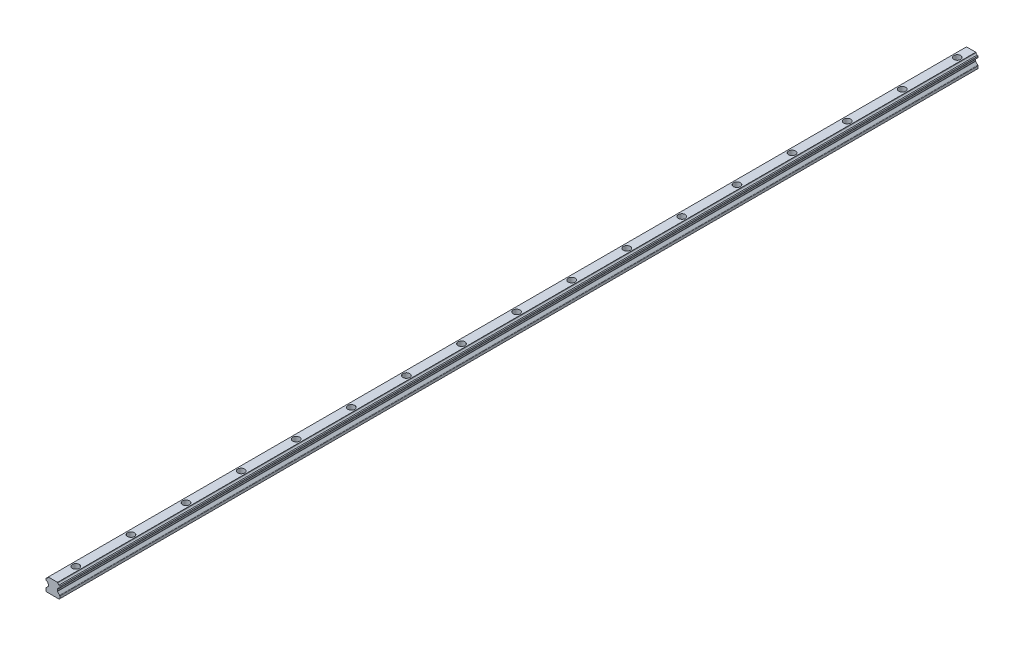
ISO-10303-21;
HEADER;
FILE_DESCRIPTION(('STEP AP214'),'2;1');
FILE_NAME('part.step','',(''),(''),'','','');
FILE_SCHEMA(('AUTOMOTIVE_DESIGN { 1 0 10303 214 1 1 1 1 }'));
ENDSEC;
DATA;
#1=APPLICATION_CONTEXT('core data for automotive mechanical design processes');
#2=APPLICATION_PROTOCOL_DEFINITION('international standard','automotive_design',2000,#1);
#3=PRODUCT_CONTEXT('',#1,'mechanical');
#4=PRODUCT('Part','Part','',(#3));
#5=PRODUCT_RELATED_PRODUCT_CATEGORY('part','',(#4));
#6=PRODUCT_DEFINITION_FORMATION('','',#4);
#7=PRODUCT_DEFINITION_CONTEXT('part definition',#1,'design');
#8=PRODUCT_DEFINITION('design','',#6,#7);
#9=PRODUCT_DEFINITION_SHAPE('','',#8);
#10=(LENGTH_UNIT() NAMED_UNIT(*) SI_UNIT(.MILLI.,.METRE.));
#11=(NAMED_UNIT(*) PLANE_ANGLE_UNIT() SI_UNIT($,.RADIAN.));
#12=(NAMED_UNIT(*) SI_UNIT($,.STERADIAN.) SOLID_ANGLE_UNIT());
#13=UNCERTAINTY_MEASURE_WITH_UNIT(LENGTH_MEASURE(1.E-05),#10,'distance_accuracy_value','');
#14=(GEOMETRIC_REPRESENTATION_CONTEXT(3) GLOBAL_UNCERTAINTY_ASSIGNED_CONTEXT((#13)) GLOBAL_UNIT_ASSIGNED_CONTEXT((#10,
#11,#12)) REPRESENTATION_CONTEXT('',''));
#15=CARTESIAN_POINT('',(0.,0.,0.));
#16=DIRECTION('',(0.,0.,1.));
#17=DIRECTION('',(1.,0.,0.));
#18=AXIS2_PLACEMENT_3D('',#15,#16,#17);
#19=CARTESIAN_POINT('',(4.91615744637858,7.10680643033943,1000.));
#20=DIRECTION('',(0.,-1.,0.));
#21=DIRECTION('',(0.,0.,-1.));
#22=AXIS2_PLACEMENT_3D('',#19,#20,#21);
#23=PLANE('',#22);
#24=CARTESIAN_POINT('',(-0.132837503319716,7.10680643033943,74.9999999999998));
#25=DIRECTION('',(0.,1.,0.));
#26=DIRECTION('',(0.,0.,1.));
#27=AXIS2_PLACEMENT_3D('',#24,#25,#26);
#28=CIRCLE('',#27,3.74999999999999);
#29=CARTESIAN_POINT('',(-0.132837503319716,7.10680643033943,78.7499999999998));
#30=VERTEX_POINT('',#29);
#31=EDGE_CURVE('E1534',#30,#30,#28,.T.);
#32=ORIENTED_EDGE('',*,*,#31,.F.);
#33=EDGE_LOOP('',(#32));
#34=FACE_BOUND('',#33,.T.);
#35=CARTESIAN_POINT('',(-0.132837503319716,7.10680643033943,135.));
#36=DIRECTION('',(0.,1.,0.));
#37=DIRECTION('',(0.,0.,1.));
#38=AXIS2_PLACEMENT_3D('',#35,#36,#37);
#39=CIRCLE('',#38,3.74999999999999);
#40=CARTESIAN_POINT('',(-0.132837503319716,7.10680643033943,138.75));
#41=VERTEX_POINT('',#40);
#42=EDGE_CURVE('E1548',#41,#41,#39,.T.);
#43=ORIENTED_EDGE('',*,*,#42,.F.);
#44=EDGE_LOOP('',(#43));
#45=FACE_BOUND('',#44,.T.);
#46=CARTESIAN_POINT('',(-0.132837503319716,7.10680643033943,254.999999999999));
#47=DIRECTION('',(0.,1.,0.));
#48=DIRECTION('',(0.,0.,1.));
#49=AXIS2_PLACEMENT_3D('',#46,#47,#48);
#50=CIRCLE('',#49,3.74999999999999);
#51=CARTESIAN_POINT('',(-0.132837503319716,7.10680643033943,258.749999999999));
#52=VERTEX_POINT('',#51);
#53=EDGE_CURVE('E1580',#52,#52,#50,.T.);
#54=ORIENTED_EDGE('',*,*,#53,.F.);
#55=EDGE_LOOP('',(#54));
#56=FACE_BOUND('',#55,.T.);
#57=CARTESIAN_POINT('',(-0.132837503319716,7.10680643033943,374.999999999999));
#58=DIRECTION('',(0.,1.,0.));
#59=DIRECTION('',(0.,0.,1.));
#60=AXIS2_PLACEMENT_3D('',#57,#58,#59);
#61=CIRCLE('',#60,3.74999999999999);
#62=CARTESIAN_POINT('',(-0.132837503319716,7.10680643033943,378.749999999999));
#63=VERTEX_POINT('',#62);
#64=EDGE_CURVE('E1612',#63,#63,#61,.T.);
#65=ORIENTED_EDGE('',*,*,#64,.F.);
#66=EDGE_LOOP('',(#65));
#67=FACE_BOUND('',#66,.T.);
#68=CARTESIAN_POINT('',(-0.132837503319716,7.10680643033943,434.999999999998));
#69=DIRECTION('',(0.,1.,0.));
#70=DIRECTION('',(0.,0.,1.));
#71=AXIS2_PLACEMENT_3D('',#68,#69,#70);
#72=CIRCLE('',#71,3.74999999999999);
#73=CARTESIAN_POINT('',(-0.132837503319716,7.10680643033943,438.749999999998));
#74=VERTEX_POINT('',#73);
#75=EDGE_CURVE('E1628',#74,#74,#72,.T.);
#76=ORIENTED_EDGE('',*,*,#75,.F.);
#77=EDGE_LOOP('',(#76));
#78=FACE_BOUND('',#77,.T.);
#79=CARTESIAN_POINT('',(-0.132837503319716,7.10680643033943,494.999999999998));
#80=DIRECTION('',(0.,1.,0.));
#81=DIRECTION('',(0.,0.,1.));
#82=AXIS2_PLACEMENT_3D('',#79,#80,#81);
#83=CIRCLE('',#82,3.74999999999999);
#84=CARTESIAN_POINT('',(-0.132837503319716,7.10680643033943,498.749999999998));
#85=VERTEX_POINT('',#84);
#86=EDGE_CURVE('E1644',#85,#85,#83,.T.);
#87=ORIENTED_EDGE('',*,*,#86,.F.);
#88=EDGE_LOOP('',(#87));
#89=FACE_BOUND('',#88,.T.);
#90=CARTESIAN_POINT('',(-0.132837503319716,7.10680643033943,554.999999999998));
#91=DIRECTION('',(0.,1.,0.));
#92=DIRECTION('',(0.,0.,1.));
#93=AXIS2_PLACEMENT_3D('',#90,#91,#92);
#94=CIRCLE('',#93,3.74999999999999);
#95=CARTESIAN_POINT('',(-0.132837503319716,7.10680643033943,558.749999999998));
#96=VERTEX_POINT('',#95);
#97=EDGE_CURVE('E1660',#96,#96,#94,.T.);
#98=ORIENTED_EDGE('',*,*,#97,.F.);
#99=EDGE_LOOP('',(#98));
#100=FACE_BOUND('',#99,.T.);
#101=CARTESIAN_POINT('',(-0.132837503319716,7.10680643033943,614.999999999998));
#102=DIRECTION('',(0.,1.,0.));
#103=DIRECTION('',(0.,0.,1.));
#104=AXIS2_PLACEMENT_3D('',#101,#102,#103);
#105=CIRCLE('',#104,3.74999999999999);
#106=CARTESIAN_POINT('',(-0.132837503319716,7.10680643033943,618.749999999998));
#107=VERTEX_POINT('',#106);
#108=EDGE_CURVE('E1676',#107,#107,#105,.T.);
#109=ORIENTED_EDGE('',*,*,#108,.F.);
#110=EDGE_LOOP('',(#109));
#111=FACE_BOUND('',#110,.T.);
#112=CARTESIAN_POINT('',(-0.132837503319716,7.10680643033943,674.999999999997));
#113=DIRECTION('',(0.,1.,0.));
#114=DIRECTION('',(0.,0.,1.));
#115=AXIS2_PLACEMENT_3D('',#112,#113,#114);
#116=CIRCLE('',#115,3.74999999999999);
#117=CARTESIAN_POINT('',(-0.132837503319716,7.10680643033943,678.749999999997));
#118=VERTEX_POINT('',#117);
#119=EDGE_CURVE('E1692',#118,#118,#116,.T.);
#120=ORIENTED_EDGE('',*,*,#119,.F.);
#121=EDGE_LOOP('',(#120));
#122=FACE_BOUND('',#121,.T.);
#123=CARTESIAN_POINT('',(-0.132837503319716,7.10680643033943,734.999999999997));
#124=DIRECTION('',(0.,1.,0.));
#125=DIRECTION('',(0.,0.,1.));
#126=AXIS2_PLACEMENT_3D('',#123,#124,#125);
#127=CIRCLE('',#126,3.74999999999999);
#128=CARTESIAN_POINT('',(-0.132837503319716,7.10680643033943,738.749999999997));
#129=VERTEX_POINT('',#128);
#130=EDGE_CURVE('E1708',#129,#129,#127,.T.);
#131=ORIENTED_EDGE('',*,*,#130,.F.);
#132=EDGE_LOOP('',(#131));
#133=FACE_BOUND('',#132,.T.);
#134=CARTESIAN_POINT('',(-0.132837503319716,7.10680643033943,794.999999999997));
#135=DIRECTION('',(0.,1.,0.));
#136=DIRECTION('',(0.,0.,1.));
#137=AXIS2_PLACEMENT_3D('',#134,#135,#136);
#138=CIRCLE('',#137,3.74999999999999);
#139=CARTESIAN_POINT('',(-0.132837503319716,7.10680643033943,798.749999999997));
#140=VERTEX_POINT('',#139);
#141=EDGE_CURVE('E1724',#140,#140,#138,.T.);
#142=ORIENTED_EDGE('',*,*,#141,.F.);
#143=EDGE_LOOP('',(#142));
#144=FACE_BOUND('',#143,.T.);
#145=CARTESIAN_POINT('',(-0.132837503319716,7.10680643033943,854.999999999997));
#146=DIRECTION('',(0.,1.,0.));
#147=DIRECTION('',(0.,0.,1.));
#148=AXIS2_PLACEMENT_3D('',#145,#146,#147);
#149=CIRCLE('',#148,3.74999999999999);
#150=CARTESIAN_POINT('',(-0.132837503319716,7.10680643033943,858.749999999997));
#151=VERTEX_POINT('',#150);
#152=EDGE_CURVE('E1740',#151,#151,#149,.T.);
#153=ORIENTED_EDGE('',*,*,#152,.F.);
#154=EDGE_LOOP('',(#153));
#155=FACE_BOUND('',#154,.T.);
#156=CARTESIAN_POINT('',(-0.132837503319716,7.10680643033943,914.999999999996));
#157=DIRECTION('',(0.,1.,0.));
#158=DIRECTION('',(0.,0.,1.));
#159=AXIS2_PLACEMENT_3D('',#156,#157,#158);
#160=CIRCLE('',#159,3.74999999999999);
#161=CARTESIAN_POINT('',(-0.132837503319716,7.10680643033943,918.749999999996));
#162=VERTEX_POINT('',#161);
#163=EDGE_CURVE('E1756',#162,#162,#160,.T.);
#164=ORIENTED_EDGE('',*,*,#163,.F.);
#165=EDGE_LOOP('',(#164));
#166=FACE_BOUND('',#165,.T.);
#167=CARTESIAN_POINT('',(-0.13283750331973,7.10680643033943,974.999999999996));
#168=DIRECTION('',(0.,1.,0.));
#169=DIRECTION('',(0.,0.,1.));
#170=AXIS2_PLACEMENT_3D('',#167,#168,#169);
#171=CIRCLE('',#170,3.74999999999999);
#172=CARTESIAN_POINT('',(-0.13283750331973,7.10680643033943,978.749999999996));
#173=VERTEX_POINT('',#172);
#174=EDGE_CURVE('E1772',#173,#173,#171,.T.);
#175=ORIENTED_EDGE('',*,*,#174,.F.);
#176=EDGE_LOOP('',(#175));
#177=FACE_BOUND('',#176,.T.);
#178=CARTESIAN_POINT('',(-0.13283750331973,7.10680643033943,15.));
#179=DIRECTION('',(0.,1.,0.));
#180=DIRECTION('',(0.,0.,1.));
#181=AXIS2_PLACEMENT_3D('',#178,#179,#180);
#182=CIRCLE('',#181,3.74999999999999);
#183=CARTESIAN_POINT('',(-0.13283750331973,7.10680643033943,18.75));
#184=VERTEX_POINT('',#183);
#185=EDGE_CURVE('E1788',#184,#184,#182,.T.);
#186=ORIENTED_EDGE('',*,*,#185,.F.);
#187=EDGE_LOOP('',(#186));
#188=FACE_BOUND('',#187,.T.);
#189=DIRECTION('',(-1.,0.,0.));
#190=VECTOR('',#189,1.);
#191=CARTESIAN_POINT('',(4.91615744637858,7.10680643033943,0.));
#192=LINE('',#191,#190);
#193=CARTESIAN_POINT('',(4.91615744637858,7.10680643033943,0.));
#194=VERTEX_POINT('',#193);
#195=CARTESIAN_POINT('',(-5.18183245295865,7.10680643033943,0.));
#196=VERTEX_POINT('',#195);
#197=EDGE_CURVE('E335',#194,#196,#192,.T.);
#198=ORIENTED_EDGE('',*,*,#197,.T.);
#199=DIRECTION('',(0.,0.,-1.));
#200=VECTOR('',#199,1.);
#201=CARTESIAN_POINT('',(-5.18183245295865,7.10680643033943,1000.));
#202=LINE('',#201,#200);
#203=CARTESIAN_POINT('',(-5.18183245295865,7.10680643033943,1000.));
#204=VERTEX_POINT('',#203);
#205=EDGE_CURVE('E487',#204,#196,#202,.T.);
#206=ORIENTED_EDGE('',*,*,#205,.F.);
#207=DIRECTION('',(-1.,0.,0.));
#208=VECTOR('',#207,1.);
#209=CARTESIAN_POINT('',(4.91615744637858,7.10680643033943,1000.));
#210=LINE('',#209,#208);
#211=CARTESIAN_POINT('',(4.91615744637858,7.10680643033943,1000.));
#212=VERTEX_POINT('',#211);
#213=EDGE_CURVE('E568',#212,#204,#210,.T.);
#214=ORIENTED_EDGE('',*,*,#213,.F.);
#215=DIRECTION('',(0.,0.,-1.));
#216=VECTOR('',#215,1.);
#217=CARTESIAN_POINT('',(4.91615744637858,7.10680643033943,1000.));
#218=LINE('',#217,#216);
#219=EDGE_CURVE('E491',#212,#194,#218,.T.);
#220=ORIENTED_EDGE('',*,*,#219,.T.);
#221=EDGE_LOOP('',(#198,#206,#214,#220));
#222=FACE_BOUND('',#221,.T.);
#223=CARTESIAN_POINT('',(-0.132837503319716,7.10680643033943,314.999999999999));
#224=DIRECTION('',(0.,1.,0.));
#225=DIRECTION('',(0.,0.,1.));
#226=AXIS2_PLACEMENT_3D('',#223,#224,#225);
#227=CIRCLE('',#226,3.74999999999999);
#228=CARTESIAN_POINT('',(-0.132837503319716,7.10680643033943,318.749999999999));
#229=VERTEX_POINT('',#228);
#230=EDGE_CURVE('E1596',#229,#229,#227,.T.);
#231=ORIENTED_EDGE('',*,*,#230,.F.);
#232=EDGE_LOOP('',(#231));
#233=FACE_BOUND('',#232,.T.);
#234=CARTESIAN_POINT('',(-0.132837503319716,7.10680643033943,194.999999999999));
#235=DIRECTION('',(0.,1.,0.));
#236=DIRECTION('',(0.,0.,1.));
#237=AXIS2_PLACEMENT_3D('',#234,#235,#236);
#238=CIRCLE('',#237,3.74999999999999);
#239=CARTESIAN_POINT('',(-0.132837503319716,7.10680643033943,198.749999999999));
#240=VERTEX_POINT('',#239);
#241=EDGE_CURVE('E1564',#240,#240,#238,.T.);
#242=ORIENTED_EDGE('',*,*,#241,.F.);
#243=EDGE_LOOP('',(#242));
#244=FACE_BOUND('',#243,.T.);
#245=ADVANCED_FACE('F45',(#34,#45,#56,#67,#78,#89,#100,#111,#122,#133,#144,#155,#166,#177,#188,
#222,#233,#244),#23,.F.);
#246=CARTESIAN_POINT('',(5.03716249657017,0.222126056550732,1000.));
#247=DIRECTION('',(0.,0.,-1.));
#248=DIRECTION('',(-1.,0.,0.));
#249=AXIS2_PLACEMENT_3D('',#246,#247,#248);
#250=CYLINDRICAL_SURFACE('',#249,0.400000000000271);
#251=CARTESIAN_POINT('',(5.03716249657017,0.222126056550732,0.));
#252=DIRECTION('',(0.,0.,-1.));
#253=DIRECTION('',(1.,0.,0.));
#254=AXIS2_PLACEMENT_3D('',#251,#252,#253);
#255=CIRCLE('',#254,0.400000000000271);
#256=CARTESIAN_POINT('',(4.6371624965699,0.222126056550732,0.));
#257=VERTEX_POINT('',#256);
#258=CARTESIAN_POINT('',(4.75431978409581,0.504968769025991,0.));
#259=VERTEX_POINT('',#258);
#260=EDGE_CURVE('E303',#257,#259,#255,.T.);
#261=ORIENTED_EDGE('',*,*,#260,.T.);
#262=DIRECTION('',(0.,0.,-1.));
#263=VECTOR('',#262,1.);
#264=CARTESIAN_POINT('',(4.75431978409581,0.504968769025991,1000.));
#265=LINE('',#264,#263);
#266=CARTESIAN_POINT('',(4.75431978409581,0.504968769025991,1000.));
#267=VERTEX_POINT('',#266);
#268=EDGE_CURVE('E12',#267,#259,#265,.T.);
#269=ORIENTED_EDGE('',*,*,#268,.F.);
#270=CARTESIAN_POINT('',(5.03716249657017,0.222126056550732,1000.));
#271=DIRECTION('',(0.,0.,-1.));
#272=DIRECTION('',(1.,0.,0.));
#273=AXIS2_PLACEMENT_3D('',#270,#271,#272);
#274=CIRCLE('',#273,0.400000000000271);
#275=CARTESIAN_POINT('',(4.6371624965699,0.222126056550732,1000.));
#276=VERTEX_POINT('',#275);
#277=EDGE_CURVE('E404',#276,#267,#274,.T.);
#278=ORIENTED_EDGE('',*,*,#277,.F.);
#279=DIRECTION('',(0.,0.,-1.));
#280=VECTOR('',#279,1.);
#281=CARTESIAN_POINT('',(4.6371624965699,0.222126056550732,1000.));
#282=LINE('',#281,#280);
#283=EDGE_CURVE('E299',#276,#257,#282,.T.);
#284=ORIENTED_EDGE('',*,*,#283,.T.);
#285=EDGE_LOOP('',(#261,#269,#278,#284));
#286=FACE_BOUND('',#285,.T.);
#287=ADVANCED_FACE('F47',(#286),#250,.F.);
#288=CARTESIAN_POINT('',(4.75431978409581,0.504968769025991,1000.));
#289=DIRECTION('',(-0.707106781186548,0.707106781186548,0.));
#290=DIRECTION('',(-0.707106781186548,-0.707106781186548,0.));
#291=AXIS2_PLACEMENT_3D('',#288,#289,#290);
#292=PLANE('',#291);
#293=DIRECTION('',(0.707106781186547,0.707106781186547,0.));
#294=VECTOR('',#293,1.);
#295=CARTESIAN_POINT('',(4.75431978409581,0.504968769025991,0.));
#296=LINE('',#295,#294);
#297=CARTESIAN_POINT('',(4.97036008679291,0.721009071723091,0.));
#298=VERTEX_POINT('',#297);
#299=EDGE_CURVE('E307',#259,#298,#296,.T.);
#300=ORIENTED_EDGE('',*,*,#299,.T.);
#301=DIRECTION('',(0.,0.,-1.));
#302=VECTOR('',#301,1.);
#303=CARTESIAN_POINT('',(4.97036008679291,0.721009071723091,1000.));
#304=LINE('',#303,#302);
#305=CARTESIAN_POINT('',(4.97036008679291,0.721009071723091,1000.));
#306=VERTEX_POINT('',#305);
#307=EDGE_CURVE('E55',#306,#298,#304,.T.);
#308=ORIENTED_EDGE('',*,*,#307,.F.);
#309=DIRECTION('',(0.707106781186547,0.707106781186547,0.));
#310=VECTOR('',#309,1.);
#311=CARTESIAN_POINT('',(4.75431978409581,0.504968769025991,1000.));
#312=LINE('',#311,#310);
#313=EDGE_CURVE('E184',#267,#306,#312,.T.);
#314=ORIENTED_EDGE('',*,*,#313,.F.);
#315=ORIENTED_EDGE('',*,*,#268,.T.);
#316=EDGE_LOOP('',(#300,#308,#314,#315));
#317=FACE_BOUND('',#316,.T.);
#318=ADVANCED_FACE('F657',(#317),#292,.F.);
#319=CARTESIAN_POINT('',(4.68751737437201,1.00385178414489,1000.));
#320=DIRECTION('',(0.,0.,-1.));
#321=DIRECTION('',(-1.,0.,0.));
#322=AXIS2_PLACEMENT_3D('',#319,#320,#321);
#323=CYLINDRICAL_SURFACE('',#322,0.399999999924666);
#324=CARTESIAN_POINT('',(4.68751737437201,1.00385178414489,0.));
#325=DIRECTION('',(0.,0.,1.));
#326=DIRECTION('',(1.,0.,0.));
#327=AXIS2_PLACEMENT_3D('',#324,#325,#326);
#328=CIRCLE('',#327,0.399999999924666);
#329=CARTESIAN_POINT('',(5.08413501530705,0.95194372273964,0.));
#330=VERTEX_POINT('',#329);
#331=EDGE_CURVE('E311',#298,#330,#328,.T.);
#332=ORIENTED_EDGE('',*,*,#331,.T.);
#333=DIRECTION('',(0.,0.,-1.));
#334=VECTOR('',#333,1.);
#335=CARTESIAN_POINT('',(5.08413501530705,0.95194372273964,1000.));
#336=LINE('',#335,#334);
#337=CARTESIAN_POINT('',(5.08413501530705,0.95194372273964,1000.));
#338=VERTEX_POINT('',#337);
#339=EDGE_CURVE('E519',#338,#330,#336,.T.);
#340=ORIENTED_EDGE('',*,*,#339,.F.);
#341=CARTESIAN_POINT('',(4.68751737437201,1.00385178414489,1000.));
#342=DIRECTION('',(0.,0.,1.));
#343=DIRECTION('',(1.,0.,0.));
#344=AXIS2_PLACEMENT_3D('',#341,#342,#343);
#345=CIRCLE('',#344,0.399999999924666);
#346=EDGE_CURVE('E529',#306,#338,#345,.T.);
#347=ORIENTED_EDGE('',*,*,#346,.F.);
#348=ORIENTED_EDGE('',*,*,#307,.T.);
#349=EDGE_LOOP('',(#332,#340,#347,#348));
#350=FACE_BOUND('',#349,.T.);
#351=ADVANCED_FACE('F527',(#350),#323,.T.);
#352=CARTESIAN_POINT('',(6.69043645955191,0.741716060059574,1000.));
#353=DIRECTION('',(0.,0.,-1.));
#354=DIRECTION('',(-1.,0.,0.));
#355=AXIS2_PLACEMENT_3D('',#352,#353,#354);
#356=CYLINDRICAL_SURFACE('',#355,1.61999999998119);
#357=CARTESIAN_POINT('',(6.69043645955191,0.741716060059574,0.));
#358=DIRECTION('',(0.,0.,-1.));
#359=DIRECTION('',(1.,0.,0.));
#360=AXIS2_PLACEMENT_3D('',#357,#358,#359);
#361=CIRCLE('',#360,1.61999999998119);
#362=CARTESIAN_POINT('',(6.60901990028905,2.359668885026,0.));
#363=VERTEX_POINT('',#362);
#364=EDGE_CURVE('E314',#330,#363,#361,.T.);
#365=ORIENTED_EDGE('',*,*,#364,.T.);
#366=DIRECTION('',(0.,0.,-1.));
#367=VECTOR('',#366,1.);
#368=CARTESIAN_POINT('',(6.60901990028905,2.359668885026,1000.));
#369=LINE('',#368,#367);
#370=CARTESIAN_POINT('',(6.60901990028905,2.359668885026,1000.));
#371=VERTEX_POINT('',#370);
#372=EDGE_CURVE('E515',#371,#363,#369,.T.);
#373=ORIENTED_EDGE('',*,*,#372,.F.);
#374=CARTESIAN_POINT('',(6.69043645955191,0.741716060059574,1000.));
#375=DIRECTION('',(0.,0.,-1.));
#376=DIRECTION('',(1.,0.,0.));
#377=AXIS2_PLACEMENT_3D('',#374,#375,#376);
#378=CIRCLE('',#377,1.61999999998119);
#379=EDGE_CURVE('E548',#338,#371,#378,.T.);
#380=ORIENTED_EDGE('',*,*,#379,.F.);
#381=ORIENTED_EDGE('',*,*,#339,.T.);
#382=EDGE_LOOP('',(#365,#373,#380,#381));
#383=FACE_BOUND('',#382,.T.);
#384=ADVANCED_FACE('F538',(#383),#356,.F.);
#385=CARTESIAN_POINT('',(6.60901990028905,2.359668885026,1000.));
#386=DIRECTION('',(-0.707106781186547,0.707106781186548,0.));
#387=DIRECTION('',(-0.707106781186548,-0.707106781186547,0.));
#388=AXIS2_PLACEMENT_3D('',#385,#386,#387);
#389=PLANE('',#388);
#390=DIRECTION('',(0.707106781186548,0.707106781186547,0.));
#391=VECTOR('',#390,1.);
#392=CARTESIAN_POINT('',(6.60901990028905,2.359668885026,0.));
#393=LINE('',#392,#391);
#394=CARTESIAN_POINT('',(7.36716249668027,3.11781148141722,0.));
#395=VERTEX_POINT('',#394);
#396=EDGE_CURVE('E317',#363,#395,#393,.T.);
#397=ORIENTED_EDGE('',*,*,#396,.T.);
#398=DIRECTION('',(0.,0.,-1.));
#399=VECTOR('',#398,1.);
#400=CARTESIAN_POINT('',(7.36716249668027,3.11781148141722,1000.));
#401=LINE('',#400,#399);
#402=CARTESIAN_POINT('',(7.36716249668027,3.11781148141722,1000.));
#403=VERTEX_POINT('',#402);
#404=EDGE_CURVE('E511',#403,#395,#401,.T.);
#405=ORIENTED_EDGE('',*,*,#404,.F.);
#406=DIRECTION('',(0.707106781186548,0.707106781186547,0.));
#407=VECTOR('',#406,1.);
#408=CARTESIAN_POINT('',(6.60901990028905,2.359668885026,1000.));
#409=LINE('',#408,#407);
#410=EDGE_CURVE('E544',#371,#403,#409,.T.);
#411=ORIENTED_EDGE('',*,*,#410,.F.);
#412=ORIENTED_EDGE('',*,*,#372,.T.);
#413=EDGE_LOOP('',(#397,#405,#411,#412));
#414=FACE_BOUND('',#413,.T.);
#415=ADVANCED_FACE('F542',(#414),#389,.F.);
#416=CARTESIAN_POINT('',(7.36716249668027,3.11781148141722,1000.));
#417=DIRECTION('',(-1.,0.,0.));
#418=DIRECTION('',(0.,0.,1.));
#419=AXIS2_PLACEMENT_3D('',#416,#417,#418);
#420=PLANE('',#419);
#421=DIRECTION('',(0.,1.,0.));
#422=VECTOR('',#421,1.);
#423=CARTESIAN_POINT('',(7.36716249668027,3.11781148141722,0.));
#424=LINE('',#423,#422);
#425=CARTESIAN_POINT('',(7.36716249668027,4.65580138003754,0.));
#426=VERTEX_POINT('',#425);
#427=EDGE_CURVE('E320',#395,#426,#424,.T.);
#428=ORIENTED_EDGE('',*,*,#427,.T.);
#429=DIRECTION('',(0.,0.,-1.));
#430=VECTOR('',#429,1.);
#431=CARTESIAN_POINT('',(7.36716249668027,4.65580138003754,1000.));
#432=LINE('',#431,#430);
#433=CARTESIAN_POINT('',(7.36716249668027,4.65580138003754,1000.));
#434=VERTEX_POINT('',#433);
#435=EDGE_CURVE('E507',#434,#426,#432,.T.);
#436=ORIENTED_EDGE('',*,*,#435,.F.);
#437=DIRECTION('',(0.,1.,0.));
#438=VECTOR('',#437,1.);
#439=CARTESIAN_POINT('',(7.36716249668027,3.11781148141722,1000.));
#440=LINE('',#439,#438);
#441=EDGE_CURVE('E547',#403,#434,#440,.T.);
#442=ORIENTED_EDGE('',*,*,#441,.F.);
#443=ORIENTED_EDGE('',*,*,#404,.T.);
#444=EDGE_LOOP('',(#428,#436,#442,#443));
#445=FACE_BOUND('',#444,.T.);
#446=ADVANCED_FACE('F679',(#445),#420,.F.);
#447=CARTESIAN_POINT('',(7.36716249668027,4.65580138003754,1000.));
#448=DIRECTION('',(-0.707106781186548,-0.707106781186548,0.));
#449=DIRECTION('',(0.707106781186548,-0.707106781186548,0.));
#450=AXIS2_PLACEMENT_3D('',#447,#448,#449);
#451=PLANE('',#450);
#452=DIRECTION('',(-0.707106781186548,0.707106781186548,0.));
#453=VECTOR('',#452,1.);
#454=CARTESIAN_POINT('',(7.36716249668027,4.65580138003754,0.));
#455=LINE('',#454,#453);
#456=CARTESIAN_POINT('',(6.59752172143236,5.42544215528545,0.));
#457=VERTEX_POINT('',#456);
#458=EDGE_CURVE('E323',#426,#457,#455,.T.);
#459=ORIENTED_EDGE('',*,*,#458,.T.);
#460=DIRECTION('',(0.,0.,-1.));
#461=VECTOR('',#460,1.);
#462=CARTESIAN_POINT('',(6.59752172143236,5.42544215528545,1000.));
#463=LINE('',#462,#461);
#464=CARTESIAN_POINT('',(6.59752172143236,5.42544215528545,1000.));
#465=VERTEX_POINT('',#464);
#466=EDGE_CURVE('E503',#465,#457,#463,.T.);
#467=ORIENTED_EDGE('',*,*,#466,.F.);
#468=DIRECTION('',(-0.707106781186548,0.707106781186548,0.));
#469=VECTOR('',#468,1.);
#470=CARTESIAN_POINT('',(7.36716249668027,4.65580138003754,1000.));
#471=LINE('',#470,#469);
#472=EDGE_CURVE('E552',#434,#465,#471,.T.);
#473=ORIENTED_EDGE('',*,*,#472,.F.);
#474=ORIENTED_EDGE('',*,*,#435,.T.);
#475=EDGE_LOOP('',(#459,#467,#473,#474));
#476=FACE_BOUND('',#475,.T.);
#477=ADVANCED_FACE('F675',(#476),#451,.F.);
#478=CARTESIAN_POINT('',(6.69043645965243,7.04277540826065,1000.));
#479=DIRECTION('',(0.,0.,-1.));
#480=DIRECTION('',(-1.,0.,0.));
#481=AXIS2_PLACEMENT_3D('',#478,#479,#480);
#482=CYLINDRICAL_SURFACE('',#481,1.61999999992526);
#483=CARTESIAN_POINT('',(6.69043645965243,7.04277540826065,0.));
#484=DIRECTION('',(0.,0.,-1.));
#485=DIRECTION('',(1.,0.,0.));
#486=AXIS2_PLACEMENT_3D('',#483,#484,#485);
#487=CIRCLE('',#486,1.61999999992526);
#488=CARTESIAN_POINT('',(5.08548579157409,6.8224725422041,0.));
#489=VERTEX_POINT('',#488);
#490=EDGE_CURVE('E326',#457,#489,#487,.T.);
#491=ORIENTED_EDGE('',*,*,#490,.T.);
#492=DIRECTION('',(0.,0.,-1.));
#493=VECTOR('',#492,1.);
#494=CARTESIAN_POINT('',(5.08548579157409,6.8224725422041,1000.));
#495=LINE('',#494,#493);
#496=CARTESIAN_POINT('',(5.08548579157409,6.8224725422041,1000.));
#497=VERTEX_POINT('',#496);
#498=EDGE_CURVE('E499',#497,#489,#495,.T.);
#499=ORIENTED_EDGE('',*,*,#498,.F.);
#500=CARTESIAN_POINT('',(6.69043645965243,7.04277540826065,1000.));
#501=DIRECTION('',(0.,0.,-1.));
#502=DIRECTION('',(1.,0.,0.));
#503=AXIS2_PLACEMENT_3D('',#500,#501,#502);
#504=CIRCLE('',#503,1.61999999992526);
#505=EDGE_CURVE('E559',#465,#497,#504,.T.);
#506=ORIENTED_EDGE('',*,*,#505,.F.);
#507=ORIENTED_EDGE('',*,*,#466,.T.);
#508=EDGE_LOOP('',(#491,#499,#506,#507));
#509=FACE_BOUND('',#508,.T.);
#510=ADVANCED_FACE('F671',(#509),#482,.F.);
#511=CARTESIAN_POINT('',(4.68920167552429,6.76807677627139,1000.));
#512=DIRECTION('',(0.,0.,-1.));
#513=DIRECTION('',(-1.,0.,0.));
#514=AXIS2_PLACEMENT_3D('',#511,#512,#513);
#515=CYLINDRICAL_SURFACE('',#514,0.399999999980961);
#516=CARTESIAN_POINT('',(4.68920167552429,6.76807677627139,0.));
#517=DIRECTION('',(0.,0.,1.));
#518=DIRECTION('',(1.,0.,0.));
#519=AXIS2_PLACEMENT_3D('',#516,#517,#518);
#520=CIRCLE('',#519,0.399999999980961);
#521=CARTESIAN_POINT('',(4.97204438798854,7.05091948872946,0.));
#522=VERTEX_POINT('',#521);
#523=EDGE_CURVE('E329',#489,#522,#520,.T.);
#524=ORIENTED_EDGE('',*,*,#523,.T.);
#525=DIRECTION('',(0.,0.,-1.));
#526=VECTOR('',#525,1.);
#527=CARTESIAN_POINT('',(4.97204438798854,7.05091948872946,1000.));
#528=LINE('',#527,#526);
#529=CARTESIAN_POINT('',(4.97204438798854,7.05091948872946,1000.));
#530=VERTEX_POINT('',#529);
#531=EDGE_CURVE('E495',#530,#522,#528,.T.);
#532=ORIENTED_EDGE('',*,*,#531,.F.);
#533=CARTESIAN_POINT('',(4.68920167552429,6.76807677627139,1000.));
#534=DIRECTION('',(0.,0.,1.));
#535=DIRECTION('',(1.,0.,0.));
#536=AXIS2_PLACEMENT_3D('',#533,#534,#535);
#537=CIRCLE('',#536,0.399999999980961);
#538=EDGE_CURVE('E562',#497,#530,#537,.T.);
#539=ORIENTED_EDGE('',*,*,#538,.F.);
#540=ORIENTED_EDGE('',*,*,#498,.T.);
#541=EDGE_LOOP('',(#524,#532,#539,#540));
#542=FACE_BOUND('',#541,.T.);
#543=ADVANCED_FACE('F667',(#542),#515,.T.);
#544=CARTESIAN_POINT('',(4.97204438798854,7.05091948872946,1000.));
#545=DIRECTION('',(-0.707106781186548,-0.707106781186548,0.));
#546=DIRECTION('',(0.707106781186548,-0.707106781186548,0.));
#547=AXIS2_PLACEMENT_3D('',#544,#545,#546);
#548=PLANE('',#547);
#549=DIRECTION('',(-0.707106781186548,0.707106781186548,0.));
#550=VECTOR('',#549,1.);
#551=CARTESIAN_POINT('',(4.97204438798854,7.05091948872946,0.));
#552=LINE('',#551,#550);
#553=EDGE_CURVE('E332',#522,#194,#552,.T.);
#554=ORIENTED_EDGE('',*,*,#553,.T.);
#555=ORIENTED_EDGE('',*,*,#219,.F.);
#556=DIRECTION('',(-0.707106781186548,0.707106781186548,0.));
#557=VECTOR('',#556,1.);
#558=CARTESIAN_POINT('',(4.97204438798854,7.05091948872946,1000.));
#559=LINE('',#558,#557);
#560=EDGE_CURVE('E565',#530,#212,#559,.T.);
#561=ORIENTED_EDGE('',*,*,#560,.F.);
#562=ORIENTED_EDGE('',*,*,#531,.T.);
#563=EDGE_LOOP('',(#554,#555,#561,#562));
#564=FACE_BOUND('',#563,.T.);
#565=ADVANCED_FACE('F664',(#564),#548,.F.);
#566=CARTESIAN_POINT('',(-5.18183245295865,7.10680643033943,1000.));
#567=DIRECTION('',(0.707106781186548,-0.707106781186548,0.));
#568=DIRECTION('',(0.707106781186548,0.707106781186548,0.));
#569=AXIS2_PLACEMENT_3D('',#566,#567,#568);
#570=PLANE('',#569);
#571=DIRECTION('',(-0.707106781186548,-0.707106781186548,0.));
#572=VECTOR('',#571,1.);
#573=CARTESIAN_POINT('',(-5.18183245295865,7.10680643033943,0.));
#574=LINE('',#573,#572);
#575=CARTESIAN_POINT('',(-5.23771939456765,7.05091948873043,0.));
#576=VERTEX_POINT('',#575);
#577=EDGE_CURVE('E338',#196,#576,#574,.T.);
#578=ORIENTED_EDGE('',*,*,#577,.T.);
#579=DIRECTION('',(0.,0.,-1.));
#580=VECTOR('',#579,1.);
#581=CARTESIAN_POINT('',(-5.23771939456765,7.05091948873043,1000.));
#582=LINE('',#581,#580);
#583=CARTESIAN_POINT('',(-5.23771939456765,7.05091948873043,1000.));
#584=VERTEX_POINT('',#583);
#585=EDGE_CURVE('E483',#584,#576,#582,.T.);
#586=ORIENTED_EDGE('',*,*,#585,.F.);
#587=DIRECTION('',(-0.707106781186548,-0.707106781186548,0.));
#588=VECTOR('',#587,1.);
#589=CARTESIAN_POINT('',(-5.18183245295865,7.10680643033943,1000.));
#590=LINE('',#589,#588);
#591=EDGE_CURVE('E571',#204,#584,#590,.T.);
#592=ORIENTED_EDGE('',*,*,#591,.F.);
#593=ORIENTED_EDGE('',*,*,#205,.T.);
#594=EDGE_LOOP('',(#578,#586,#592,#593));
#595=FACE_BOUND('',#594,.T.);
#596=ADVANCED_FACE('F662',(#595),#570,.F.);
#597=CARTESIAN_POINT('',(-4.9548766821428,6.76807677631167,1000.));
#598=DIRECTION('',(0.,0.,-1.));
#599=DIRECTION('',(-1.,0.,0.));
#600=AXIS2_PLACEMENT_3D('',#597,#598,#599);
#601=CYLINDRICAL_SURFACE('',#600,0.399999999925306);
#602=CARTESIAN_POINT('',(-4.9548766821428,6.76807677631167,0.));
#603=DIRECTION('',(0.,0.,1.));
#604=DIRECTION('',(1.,0.,0.));
#605=AXIS2_PLACEMENT_3D('',#602,#603,#604);
#606=CIRCLE('',#605,0.399999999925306);
#607=CARTESIAN_POINT('',(-5.35116079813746,6.82247254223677,0.));
#608=VERTEX_POINT('',#607);
#609=EDGE_CURVE('E341',#576,#608,#606,.T.);
#610=ORIENTED_EDGE('',*,*,#609,.T.);
#611=DIRECTION('',(0.,0.,-1.));
#612=VECTOR('',#611,1.);
#613=CARTESIAN_POINT('',(-5.35116079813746,6.82247254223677,1000.));
#614=LINE('',#613,#612);
#615=CARTESIAN_POINT('',(-5.35116079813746,6.82247254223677,1000.));
#616=VERTEX_POINT('',#615);
#617=EDGE_CURVE('E479',#616,#608,#614,.T.);
#618=ORIENTED_EDGE('',*,*,#617,.F.);
#619=CARTESIAN_POINT('',(-4.9548766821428,6.76807677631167,1000.));
#620=DIRECTION('',(0.,0.,1.));
#621=DIRECTION('',(1.,0.,0.));
#622=AXIS2_PLACEMENT_3D('',#619,#620,#621);
#623=CIRCLE('',#622,0.399999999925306);
#624=EDGE_CURVE('E574',#584,#616,#623,.T.);
#625=ORIENTED_EDGE('',*,*,#624,.F.);
#626=ORIENTED_EDGE('',*,*,#585,.T.);
#627=EDGE_LOOP('',(#610,#618,#625,#626));
#628=FACE_BOUND('',#627,.T.);
#629=ADVANCED_FACE('F732',(#628),#601,.T.);
#630=CARTESIAN_POINT('',(-6.95611146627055,7.0427754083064,1000.));
#631=DIRECTION('',(0.,0.,-1.));
#632=DIRECTION('',(-1.,0.,0.));
#633=AXIS2_PLACEMENT_3D('',#630,#631,#632);
#634=CYLINDRICAL_SURFACE('',#633,1.61999999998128);
#635=CARTESIAN_POINT('',(-6.95611146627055,7.0427754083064,0.));
#636=DIRECTION('',(0.,0.,-1.));
#637=DIRECTION('',(1.,0.,0.));
#638=AXIS2_PLACEMENT_3D('',#635,#636,#637);
#639=CIRCLE('',#638,1.61999999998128);
#640=CARTESIAN_POINT('',(-6.863196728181,5.42544215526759,0.));
#641=VERTEX_POINT('',#640);
#642=EDGE_CURVE('E344',#608,#641,#639,.T.);
#643=ORIENTED_EDGE('',*,*,#642,.T.);
#644=DIRECTION('',(0.,0.,-1.));
#645=VECTOR('',#644,1.);
#646=CARTESIAN_POINT('',(-6.863196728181,5.42544215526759,1000.));
#647=LINE('',#646,#645);
#648=CARTESIAN_POINT('',(-6.863196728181,5.42544215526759,1000.));
#649=VERTEX_POINT('',#648);
#650=EDGE_CURVE('E475',#649,#641,#647,.T.);
#651=ORIENTED_EDGE('',*,*,#650,.F.);
#652=CARTESIAN_POINT('',(-6.95611146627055,7.0427754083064,1000.));
#653=DIRECTION('',(0.,0.,-1.));
#654=DIRECTION('',(1.,0.,0.));
#655=AXIS2_PLACEMENT_3D('',#652,#653,#654);
#656=CIRCLE('',#655,1.61999999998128);
#657=EDGE_CURVE('E577',#616,#649,#656,.T.);
#658=ORIENTED_EDGE('',*,*,#657,.F.);
#659=ORIENTED_EDGE('',*,*,#617,.T.);
#660=EDGE_LOOP('',(#643,#651,#658,#659));
#661=FACE_BOUND('',#660,.T.);
#662=ADVANCED_FACE('F739',(#661),#634,.F.);
#663=CARTESIAN_POINT('',(-6.863196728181,5.42544215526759,1000.));
#664=DIRECTION('',(0.707106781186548,-0.707106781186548,0.));
#665=DIRECTION('',(0.707106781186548,0.707106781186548,0.));
#666=AXIS2_PLACEMENT_3D('',#663,#664,#665);
#667=PLANE('',#666);
#668=DIRECTION('',(-0.707106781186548,-0.707106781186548,0.));
#669=VECTOR('',#668,1.);
#670=CARTESIAN_POINT('',(-6.863196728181,5.42544215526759,0.));
#671=LINE('',#670,#669);
#672=CARTESIAN_POINT('',(-7.63283750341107,4.65580138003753,0.));
#673=VERTEX_POINT('',#672);
#674=EDGE_CURVE('E347',#641,#673,#671,.T.);
#675=ORIENTED_EDGE('',*,*,#674,.T.);
#676=DIRECTION('',(0.,0.,-1.));
#677=VECTOR('',#676,1.);
#678=CARTESIAN_POINT('',(-7.63283750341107,4.65580138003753,1000.));
#679=LINE('',#678,#677);
#680=CARTESIAN_POINT('',(-7.63283750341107,4.65580138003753,1000.));
#681=VERTEX_POINT('',#680);
#682=EDGE_CURVE('E471',#681,#673,#679,.T.);
#683=ORIENTED_EDGE('',*,*,#682,.F.);
#684=DIRECTION('',(-0.707106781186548,-0.707106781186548,0.));
#685=VECTOR('',#684,1.);
#686=CARTESIAN_POINT('',(-6.863196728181,5.42544215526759,1000.));
#687=LINE('',#686,#685);
#688=EDGE_CURVE('E580',#649,#681,#687,.T.);
#689=ORIENTED_EDGE('',*,*,#688,.F.);
#690=ORIENTED_EDGE('',*,*,#650,.T.);
#691=EDGE_LOOP('',(#675,#683,#689,#690));
#692=FACE_BOUND('',#691,.T.);
#693=ADVANCED_FACE('F746',(#692),#667,.F.);
#694=CARTESIAN_POINT('',(-7.63283750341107,4.65580138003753,1000.));
#695=DIRECTION('',(1.,0.,0.));
#696=DIRECTION('',(0.,0.,-1.));
#697=AXIS2_PLACEMENT_3D('',#694,#695,#696);
#698=PLANE('',#697);
#699=DIRECTION('',(0.,-1.,0.));
#700=VECTOR('',#699,1.);
#701=CARTESIAN_POINT('',(-7.63283750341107,4.65580138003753,0.));
#702=LINE('',#701,#700);
#703=CARTESIAN_POINT('',(-7.63283750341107,3.11781148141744,0.));
#704=VERTEX_POINT('',#703);
#705=EDGE_CURVE('E350',#673,#704,#702,.T.);
#706=ORIENTED_EDGE('',*,*,#705,.T.);
#707=DIRECTION('',(0.,0.,-1.));
#708=VECTOR('',#707,1.);
#709=CARTESIAN_POINT('',(-7.63283750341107,3.11781148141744,1000.));
#710=LINE('',#709,#708);
#711=CARTESIAN_POINT('',(-7.63283750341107,3.11781148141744,1000.));
#712=VERTEX_POINT('',#711);
#713=EDGE_CURVE('E467',#712,#704,#710,.T.);
#714=ORIENTED_EDGE('',*,*,#713,.F.);
#715=DIRECTION('',(0.,-1.,0.));
#716=VECTOR('',#715,1.);
#717=CARTESIAN_POINT('',(-7.63283750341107,4.65580138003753,1000.));
#718=LINE('',#717,#716);
#719=EDGE_CURVE('E583',#681,#712,#718,.T.);
#720=ORIENTED_EDGE('',*,*,#719,.F.);
#721=ORIENTED_EDGE('',*,*,#682,.T.);
#722=EDGE_LOOP('',(#706,#714,#720,#721));
#723=FACE_BOUND('',#722,.T.);
#724=ADVANCED_FACE('F754',(#723),#698,.F.);
#725=CARTESIAN_POINT('',(-7.63283750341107,3.11781148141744,1000.));
#726=DIRECTION('',(0.707106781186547,0.707106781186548,0.));
#727=DIRECTION('',(-0.707106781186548,0.707106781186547,0.));
#728=AXIS2_PLACEMENT_3D('',#725,#726,#727);
#729=PLANE('',#728);
#730=DIRECTION('',(0.707106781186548,-0.707106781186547,0.));
#731=VECTOR('',#730,1.);
#732=CARTESIAN_POINT('',(-7.63283750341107,3.11781148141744,0.));
#733=LINE('',#732,#731);
#734=CARTESIAN_POINT('',(-6.87469490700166,2.35966888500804,0.));
#735=VERTEX_POINT('',#734);
#736=EDGE_CURVE('E353',#704,#735,#733,.T.);
#737=ORIENTED_EDGE('',*,*,#736,.T.);
#738=DIRECTION('',(0.,0.,-1.));
#739=VECTOR('',#738,1.);
#740=CARTESIAN_POINT('',(-6.87469490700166,2.35966888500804,1000.));
#741=LINE('',#740,#739);
#742=CARTESIAN_POINT('',(-6.87469490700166,2.35966888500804,1000.));
#743=VERTEX_POINT('',#742);
#744=EDGE_CURVE('E463',#743,#735,#741,.T.);
#745=ORIENTED_EDGE('',*,*,#744,.F.);
#746=DIRECTION('',(0.707106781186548,-0.707106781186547,0.));
#747=VECTOR('',#746,1.);
#748=CARTESIAN_POINT('',(-7.63283750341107,3.11781148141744,1000.));
#749=LINE('',#748,#747);
#750=EDGE_CURVE('E586',#712,#743,#749,.T.);
#751=ORIENTED_EDGE('',*,*,#750,.F.);
#752=ORIENTED_EDGE('',*,*,#713,.T.);
#753=EDGE_LOOP('',(#737,#745,#751,#752));
#754=FACE_BOUND('',#753,.T.);
#755=ADVANCED_FACE('F762',(#754),#729,.F.);
#756=CARTESIAN_POINT('',(-6.95611146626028,0.741716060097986,1000.));
#757=DIRECTION('',(0.,0.,-1.));
#758=DIRECTION('',(-1.,0.,0.));
#759=AXIS2_PLACEMENT_3D('',#756,#757,#758);
#760=CYLINDRICAL_SURFACE('',#759,1.61999999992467);
#761=CARTESIAN_POINT('',(-6.95611146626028,0.741716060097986,0.));
#762=DIRECTION('',(0.,0.,-1.));
#763=DIRECTION('',(1.,0.,0.));
#764=AXIS2_PLACEMENT_3D('',#761,#762,#763);
#765=CIRCLE('',#764,1.61999999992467);
#766=CARTESIAN_POINT('',(-5.34981002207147,0.951943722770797,0.));
#767=VERTEX_POINT('',#766);
#768=EDGE_CURVE('E356',#735,#767,#765,.T.);
#769=ORIENTED_EDGE('',*,*,#768,.T.);
#770=DIRECTION('',(0.,0.,-1.));
#771=VECTOR('',#770,1.);
#772=CARTESIAN_POINT('',(-5.34981002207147,0.951943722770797,1000.));
#773=LINE('',#772,#771);
#774=CARTESIAN_POINT('',(-5.34981002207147,0.951943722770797,1000.));
#775=VERTEX_POINT('',#774);
#776=EDGE_CURVE('E459',#775,#767,#773,.T.);
#777=ORIENTED_EDGE('',*,*,#776,.F.);
#778=CARTESIAN_POINT('',(-6.95611146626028,0.741716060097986,1000.));
#779=DIRECTION('',(0.,0.,-1.));
#780=DIRECTION('',(1.,0.,0.));
#781=AXIS2_PLACEMENT_3D('',#778,#779,#780);
#782=CIRCLE('',#781,1.61999999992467);
#783=EDGE_CURVE('E589',#743,#775,#782,.T.);
#784=ORIENTED_EDGE('',*,*,#783,.F.);
#785=ORIENTED_EDGE('',*,*,#744,.T.);
#786=EDGE_LOOP('',(#769,#777,#784,#785));
#787=FACE_BOUND('',#786,.T.);
#788=ADVANCED_FACE('F770',(#787),#760,.F.);
#789=CARTESIAN_POINT('',(-4.95319238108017,1.00385178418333,1000.));
#790=DIRECTION('',(0.,0.,-1.));
#791=DIRECTION('',(-1.,0.,0.));
#792=AXIS2_PLACEMENT_3D('',#789,#790,#791);
#793=CYLINDRICAL_SURFACE('',#792,0.399999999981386);
#794=CARTESIAN_POINT('',(-4.95319238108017,1.00385178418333,0.));
#795=DIRECTION('',(0.,0.,1.));
#796=DIRECTION('',(1.,0.,0.));
#797=AXIS2_PLACEMENT_3D('',#794,#795,#796);
#798=CIRCLE('',#797,0.399999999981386);
#799=CARTESIAN_POINT('',(-5.23603509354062,0.721009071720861,0.));
#800=VERTEX_POINT('',#799);
#801=EDGE_CURVE('E359',#767,#800,#798,.T.);
#802=ORIENTED_EDGE('',*,*,#801,.T.);
#803=DIRECTION('',(0.,0.,-1.));
#804=VECTOR('',#803,1.);
#805=CARTESIAN_POINT('',(-5.23603509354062,0.721009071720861,1000.));
#806=LINE('',#805,#804);
#807=CARTESIAN_POINT('',(-5.23603509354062,0.721009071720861,1000.));
#808=VERTEX_POINT('',#807);
#809=EDGE_CURVE('E455',#808,#800,#806,.T.);
#810=ORIENTED_EDGE('',*,*,#809,.F.);
#811=CARTESIAN_POINT('',(-4.95319238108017,1.00385178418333,1000.));
#812=DIRECTION('',(0.,0.,1.));
#813=DIRECTION('',(1.,0.,0.));
#814=AXIS2_PLACEMENT_3D('',#811,#812,#813);
#815=CIRCLE('',#814,0.399999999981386);
#816=EDGE_CURVE('E592',#775,#808,#815,.T.);
#817=ORIENTED_EDGE('',*,*,#816,.F.);
#818=ORIENTED_EDGE('',*,*,#776,.T.);
#819=EDGE_LOOP('',(#802,#810,#817,#818));
#820=FACE_BOUND('',#819,.T.);
#821=ADVANCED_FACE('F778',(#820),#793,.T.);
#822=CARTESIAN_POINT('',(-5.23603509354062,0.72100907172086,1000.));
#823=DIRECTION('',(0.707106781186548,0.707106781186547,0.));
#824=DIRECTION('',(-0.707106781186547,0.707106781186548,0.));
#825=AXIS2_PLACEMENT_3D('',#822,#823,#824);
#826=PLANE('',#825);
#827=DIRECTION('',(0.707106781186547,-0.707106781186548,0.));
#828=VECTOR('',#827,1.);
#829=CARTESIAN_POINT('',(-5.23603509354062,0.72100907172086,0.));
#830=LINE('',#829,#828);
#831=CARTESIAN_POINT('',(-5.01999479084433,0.504968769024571,0.));
#832=VERTEX_POINT('',#831);
#833=EDGE_CURVE('E362',#800,#832,#830,.T.);
#834=ORIENTED_EDGE('',*,*,#833,.T.);
#835=DIRECTION('',(0.,0.,-1.));
#836=VECTOR('',#835,1.);
#837=CARTESIAN_POINT('',(-5.01999479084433,0.504968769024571,1000.));
#838=LINE('',#837,#836);
#839=CARTESIAN_POINT('',(-5.01999479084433,0.504968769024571,1000.));
#840=VERTEX_POINT('',#839);
#841=EDGE_CURVE('E451',#840,#832,#838,.T.);
#842=ORIENTED_EDGE('',*,*,#841,.F.);
#843=DIRECTION('',(0.707106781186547,-0.707106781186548,0.));
#844=VECTOR('',#843,1.);
#845=CARTESIAN_POINT('',(-5.23603509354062,0.72100907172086,1000.));
#846=LINE('',#845,#844);
#847=EDGE_CURVE('E595',#808,#840,#846,.T.);
#848=ORIENTED_EDGE('',*,*,#847,.F.);
#849=ORIENTED_EDGE('',*,*,#809,.T.);
#850=EDGE_LOOP('',(#834,#842,#848,#849));
#851=FACE_BOUND('',#850,.T.);
#852=ADVANCED_FACE('F786',(#851),#826,.F.);
#853=CARTESIAN_POINT('',(-5.30283750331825,0.222126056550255,1000.));
#854=DIRECTION('',(0.,0.,-1.));
#855=DIRECTION('',(-1.,0.,0.));
#856=AXIS2_PLACEMENT_3D('',#853,#854,#855);
#857=CYLINDRICAL_SURFACE('',#856,0.399999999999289);
#858=CARTESIAN_POINT('',(-5.30283750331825,0.222126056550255,0.));
#859=DIRECTION('',(0.,0.,-1.));
#860=DIRECTION('',(1.,0.,0.));
#861=AXIS2_PLACEMENT_3D('',#858,#859,#860);
#862=CIRCLE('',#861,0.399999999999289);
#863=CARTESIAN_POINT('',(-4.90283750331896,0.222126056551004,0.));
#864=VERTEX_POINT('',#863);
#865=EDGE_CURVE('E365',#832,#864,#862,.T.);
#866=ORIENTED_EDGE('',*,*,#865,.T.);
#867=DIRECTION('',(0.,0.,-1.));
#868=VECTOR('',#867,1.);
#869=CARTESIAN_POINT('',(-4.90283750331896,0.222126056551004,1000.));
#870=LINE('',#869,#868);
#871=CARTESIAN_POINT('',(-4.90283750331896,0.222126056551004,1000.));
#872=VERTEX_POINT('',#871);
#873=EDGE_CURVE('E447',#872,#864,#870,.T.);
#874=ORIENTED_EDGE('',*,*,#873,.F.);
#875=CARTESIAN_POINT('',(-5.30283750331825,0.222126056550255,1000.));
#876=DIRECTION('',(0.,0.,-1.));
#877=DIRECTION('',(1.,0.,0.));
#878=AXIS2_PLACEMENT_3D('',#875,#876,#877);
#879=CIRCLE('',#878,0.399999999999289);
#880=EDGE_CURVE('E598',#840,#872,#879,.T.);
#881=ORIENTED_EDGE('',*,*,#880,.F.);
#882=ORIENTED_EDGE('',*,*,#841,.T.);
#883=EDGE_LOOP('',(#866,#874,#881,#882));
#884=FACE_BOUND('',#883,.T.);
#885=ADVANCED_FACE('F794',(#884),#857,.F.);
#886=CARTESIAN_POINT('',(-4.90283750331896,0.222126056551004,1000.));
#887=DIRECTION('',(1.,0.,0.));
#888=DIRECTION('',(0.,0.,-1.));
#889=AXIS2_PLACEMENT_3D('',#886,#887,#888);
#890=PLANE('',#889);
#891=DIRECTION('',(0.,-1.,0.));
#892=VECTOR('',#891,1.);
#893=CARTESIAN_POINT('',(-4.90283750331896,0.222126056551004,0.));
#894=LINE('',#893,#892);
#895=CARTESIAN_POINT('',(-4.90283750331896,-1.33993455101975,0.));
#896=VERTEX_POINT('',#895);
#897=EDGE_CURVE('E368',#864,#896,#894,.T.);
#898=ORIENTED_EDGE('',*,*,#897,.T.);
#899=DIRECTION('',(0.,0.,-1.));
#900=VECTOR('',#899,1.);
#901=CARTESIAN_POINT('',(-4.90283750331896,-1.33993455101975,1000.));
#902=LINE('',#901,#900);
#903=CARTESIAN_POINT('',(-4.90283750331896,-1.33993455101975,1000.));
#904=VERTEX_POINT('',#903);
#905=EDGE_CURVE('E443',#904,#896,#902,.T.);
#906=ORIENTED_EDGE('',*,*,#905,.F.);
#907=DIRECTION('',(0.,-1.,0.));
#908=VECTOR('',#907,1.);
#909=CARTESIAN_POINT('',(-4.90283750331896,0.222126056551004,1000.));
#910=LINE('',#909,#908);
#911=EDGE_CURVE('E601',#872,#904,#910,.T.);
#912=ORIENTED_EDGE('',*,*,#911,.F.);
#913=ORIENTED_EDGE('',*,*,#873,.T.);
#914=EDGE_LOOP('',(#898,#906,#912,#913));
#915=FACE_BOUND('',#914,.T.);
#916=ADVANCED_FACE('F802',(#915),#890,.F.);
#917=CARTESIAN_POINT('',(-5.30283750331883,-1.33993455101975,1000.));
#918=DIRECTION('',(0.,0.,-1.));
#919=DIRECTION('',(-1.,0.,0.));
#920=AXIS2_PLACEMENT_3D('',#917,#918,#919);
#921=CYLINDRICAL_SURFACE('',#920,0.399999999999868);
#922=CARTESIAN_POINT('',(-5.30283750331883,-1.33993455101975,0.));
#923=DIRECTION('',(0.,0.,-1.));
#924=DIRECTION('',(1.,0.,0.));
#925=AXIS2_PLACEMENT_3D('',#922,#923,#924);
#926=CIRCLE('',#925,0.399999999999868);
#927=CARTESIAN_POINT('',(-5.01999479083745,-1.62277726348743,0.));
#928=VERTEX_POINT('',#927);
#929=EDGE_CURVE('E371',#896,#928,#926,.T.);
#930=ORIENTED_EDGE('',*,*,#929,.T.);
#931=DIRECTION('',(0.,0.,-1.));
#932=VECTOR('',#931,1.);
#933=CARTESIAN_POINT('',(-5.01999479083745,-1.62277726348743,1000.));
#934=LINE('',#933,#932);
#935=CARTESIAN_POINT('',(-5.01999479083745,-1.62277726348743,1000.));
#936=VERTEX_POINT('',#935);
#937=EDGE_CURVE('E439',#936,#928,#934,.T.);
#938=ORIENTED_EDGE('',*,*,#937,.F.);
#939=CARTESIAN_POINT('',(-5.30283750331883,-1.33993455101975,1000.));
#940=DIRECTION('',(0.,0.,-1.));
#941=DIRECTION('',(1.,0.,0.));
#942=AXIS2_PLACEMENT_3D('',#939,#940,#941);
#943=CIRCLE('',#942,0.399999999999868);
#944=EDGE_CURVE('E604',#904,#936,#943,.T.);
#945=ORIENTED_EDGE('',*,*,#944,.F.);
#946=ORIENTED_EDGE('',*,*,#905,.T.);
#947=EDGE_LOOP('',(#930,#938,#945,#946));
#948=FACE_BOUND('',#947,.T.);
#949=ADVANCED_FACE('F810',(#948),#921,.F.);
#950=CARTESIAN_POINT('',(-5.01999479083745,-1.62277726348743,1000.));
#951=DIRECTION('',(0.707106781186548,-0.707106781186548,0.));
#952=DIRECTION('',(0.707106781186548,0.707106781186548,0.));
#953=AXIS2_PLACEMENT_3D('',#950,#951,#952);
#954=PLANE('',#953);
#955=DIRECTION('',(-0.707106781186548,-0.707106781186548,0.));
#956=VECTOR('',#955,1.);
#957=CARTESIAN_POINT('',(-5.01999479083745,-1.62277726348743,0.));
#958=LINE('',#957,#956);
#959=CARTESIAN_POINT('',(-7.33994428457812,-3.9427267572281,0.));
#960=VERTEX_POINT('',#959);
#961=EDGE_CURVE('E374',#928,#960,#958,.T.);
#962=ORIENTED_EDGE('',*,*,#961,.T.);
#963=DIRECTION('',(0.,0.,-1.));
#964=VECTOR('',#963,1.);
#965=CARTESIAN_POINT('',(-7.33994428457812,-3.9427267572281,1000.));
#966=LINE('',#965,#964);
#967=CARTESIAN_POINT('',(-7.33994428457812,-3.9427267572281,1000.));
#968=VERTEX_POINT('',#967);
#969=EDGE_CURVE('E435',#968,#960,#966,.T.);
#970=ORIENTED_EDGE('',*,*,#969,.F.);
#971=DIRECTION('',(-0.707106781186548,-0.707106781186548,0.));
#972=VECTOR('',#971,1.);
#973=CARTESIAN_POINT('',(-5.01999479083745,-1.62277726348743,1000.));
#974=LINE('',#973,#972);
#975=EDGE_CURVE('E607',#936,#968,#974,.T.);
#976=ORIENTED_EDGE('',*,*,#975,.F.);
#977=ORIENTED_EDGE('',*,*,#937,.T.);
#978=EDGE_LOOP('',(#962,#970,#976,#977));
#979=FACE_BOUND('',#978,.T.);
#980=ADVANCED_FACE('F818',(#979),#954,.F.);
#981=CARTESIAN_POINT('',(-6.63283750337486,-4.64983353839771,1000.));
#982=DIRECTION('',(0.,0.,-1.));
#983=DIRECTION('',(-1.,0.,0.));
#984=AXIS2_PLACEMENT_3D('',#981,#982,#983);
#985=CYLINDRICAL_SURFACE('',#984,0.999999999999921);
#986=CARTESIAN_POINT('',(-6.63283750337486,-4.64983353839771,0.));
#987=DIRECTION('',(0.,0.,1.));
#988=DIRECTION('',(1.,0.,0.));
#989=AXIS2_PLACEMENT_3D('',#986,#987,#988);
#990=CIRCLE('',#989,0.999999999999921);
#991=CARTESIAN_POINT('',(-7.63283750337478,-4.64983353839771,0.));
#992=VERTEX_POINT('',#991);
#993=EDGE_CURVE('E377',#960,#992,#990,.T.);
#994=ORIENTED_EDGE('',*,*,#993,.T.);
#995=DIRECTION('',(0.,0.,-1.));
#996=VECTOR('',#995,1.);
#997=CARTESIAN_POINT('',(-7.63283750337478,-4.64983353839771,1000.));
#998=LINE('',#997,#996);
#999=CARTESIAN_POINT('',(-7.63283750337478,-4.64983353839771,1000.));
#1000=VERTEX_POINT('',#999);
#1001=EDGE_CURVE('E431',#1000,#992,#998,.T.);
#1002=ORIENTED_EDGE('',*,*,#1001,.F.);
#1003=CARTESIAN_POINT('',(-6.63283750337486,-4.64983353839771,1000.));
#1004=DIRECTION('',(0.,0.,1.));
#1005=DIRECTION('',(1.,0.,0.));
#1006=AXIS2_PLACEMENT_3D('',#1003,#1004,#1005);
#1007=CIRCLE('',#1006,0.999999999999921);
#1008=EDGE_CURVE('E610',#968,#1000,#1007,.T.);
#1009=ORIENTED_EDGE('',*,*,#1008,.F.);
#1010=ORIENTED_EDGE('',*,*,#969,.T.);
#1011=EDGE_LOOP('',(#994,#1002,#1009,#1010));
#1012=FACE_BOUND('',#1011,.T.);
#1013=ADVANCED_FACE('F826',(#1012),#985,.T.);
#1014=CARTESIAN_POINT('',(-7.63283750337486,-4.64983353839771,1000.));
#1015=DIRECTION('',(1.,0.,0.));
#1016=DIRECTION('',(0.,1.,0.));
#1017=AXIS2_PLACEMENT_3D('',#1014,#1015,#1016);
#1018=PLANE('',#1017);
#1019=DIRECTION('',(0.,-1.,0.));
#1020=VECTOR('',#1019,1.);
#1021=CARTESIAN_POINT('',(-7.63283750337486,-4.64983353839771,0.));
#1022=LINE('',#1021,#1020);
#1023=CARTESIAN_POINT('',(-7.63283750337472,-7.19319356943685,0.));
#1024=VERTEX_POINT('',#1023);
#1025=EDGE_CURVE('E380',#992,#1024,#1022,.T.);
#1026=ORIENTED_EDGE('',*,*,#1025,.T.);
#1027=DIRECTION('',(0.,0.,-1.));
#1028=VECTOR('',#1027,1.);
#1029=CARTESIAN_POINT('',(-7.63283750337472,-7.19319356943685,1000.));
#1030=LINE('',#1029,#1028);
#1031=CARTESIAN_POINT('',(-7.63283750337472,-7.19319356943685,1000.));
#1032=VERTEX_POINT('',#1031);
#1033=EDGE_CURVE('E427',#1032,#1024,#1030,.T.);
#1034=ORIENTED_EDGE('',*,*,#1033,.F.);
#1035=DIRECTION('',(0.,-1.,0.));
#1036=VECTOR('',#1035,1.);
#1037=CARTESIAN_POINT('',(-7.63283750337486,-4.64983353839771,1000.));
#1038=LINE('',#1037,#1036);
#1039=EDGE_CURVE('E613',#1000,#1032,#1038,.T.);
#1040=ORIENTED_EDGE('',*,*,#1039,.F.);
#1041=ORIENTED_EDGE('',*,*,#1001,.T.);
#1042=EDGE_LOOP('',(#1026,#1034,#1040,#1041));
#1043=FACE_BOUND('',#1042,.T.);
#1044=ADVANCED_FACE('F834',(#1043),#1018,.F.);
#1045=CARTESIAN_POINT('',(-7.63283750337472,-7.19319356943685,1000.));
#1046=DIRECTION('',(0.707106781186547,0.707106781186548,0.));
#1047=DIRECTION('',(-0.707106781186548,0.707106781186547,0.));
#1048=AXIS2_PLACEMENT_3D('',#1045,#1046,#1047);
#1049=PLANE('',#1048);
#1050=DIRECTION('',(0.707106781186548,-0.707106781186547,0.));
#1051=VECTOR('',#1050,1.);
#1052=CARTESIAN_POINT('',(-7.63283750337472,-7.19319356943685,0.));
#1053=LINE('',#1052,#1051);
#1054=CARTESIAN_POINT('',(-6.93283750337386,-7.89319356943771,0.));
#1055=VERTEX_POINT('',#1054);
#1056=EDGE_CURVE('E383',#1024,#1055,#1053,.T.);
#1057=ORIENTED_EDGE('',*,*,#1056,.T.);
#1058=DIRECTION('',(0.,0.,-1.));
#1059=VECTOR('',#1058,1.);
#1060=CARTESIAN_POINT('',(-6.93283750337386,-7.89319356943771,1000.));
#1061=LINE('',#1060,#1059);
#1062=CARTESIAN_POINT('',(-6.93283750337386,-7.89319356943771,1000.));
#1063=VERTEX_POINT('',#1062);
#1064=EDGE_CURVE('E423',#1063,#1055,#1061,.T.);
#1065=ORIENTED_EDGE('',*,*,#1064,.F.);
#1066=DIRECTION('',(0.707106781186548,-0.707106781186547,0.));
#1067=VECTOR('',#1066,1.);
#1068=CARTESIAN_POINT('',(-7.63283750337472,-7.19319356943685,1000.));
#1069=LINE('',#1068,#1067);
#1070=EDGE_CURVE('E616',#1032,#1063,#1069,.T.);
#1071=ORIENTED_EDGE('',*,*,#1070,.F.);
#1072=ORIENTED_EDGE('',*,*,#1033,.T.);
#1073=EDGE_LOOP('',(#1057,#1065,#1071,#1072));
#1074=FACE_BOUND('',#1073,.T.);
#1075=ADVANCED_FACE('F842',(#1074),#1049,.F.);
#1076=CARTESIAN_POINT('',(-6.93283750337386,-7.89319356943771,1000.));
#1077=DIRECTION('',(0.,1.,0.));
#1078=DIRECTION('',(0.,0.,1.));
#1079=AXIS2_PLACEMENT_3D('',#1076,#1077,#1078);
#1080=PLANE('',#1079);
#1081=CARTESIAN_POINT('',(-0.132837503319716,-7.89319356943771,74.9999999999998));
#1082=DIRECTION('',(0.,1.,0.));
#1083=DIRECTION('',(0.,0.,1.));
#1084=AXIS2_PLACEMENT_3D('',#1081,#1082,#1083);
#1085=CIRCLE('',#1084,2.25);
#1086=CARTESIAN_POINT('',(-0.132837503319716,-7.89319356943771,77.2499999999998));
#1087=VERTEX_POINT('',#1086);
#1088=EDGE_CURVE('E1544',#1087,#1087,#1085,.T.);
#1089=ORIENTED_EDGE('',*,*,#1088,.T.);
#1090=EDGE_LOOP('',(#1089));
#1091=FACE_BOUND('',#1090,.T.);
#1092=CARTESIAN_POINT('',(-0.132837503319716,-7.89319356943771,135.));
#1093=DIRECTION('',(0.,1.,0.));
#1094=DIRECTION('',(0.,0.,1.));
#1095=AXIS2_PLACEMENT_3D('',#1092,#1093,#1094);
#1096=CIRCLE('',#1095,2.25);
#1097=CARTESIAN_POINT('',(-0.132837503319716,-7.89319356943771,137.25));
#1098=VERTEX_POINT('',#1097);
#1099=EDGE_CURVE('E1560',#1098,#1098,#1096,.T.);
#1100=ORIENTED_EDGE('',*,*,#1099,.T.);
#1101=EDGE_LOOP('',(#1100));
#1102=FACE_BOUND('',#1101,.T.);
#1103=CARTESIAN_POINT('',(-0.132837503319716,-7.89319356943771,194.999999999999));
#1104=DIRECTION('',(0.,1.,0.));
#1105=DIRECTION('',(0.,0.,1.));
#1106=AXIS2_PLACEMENT_3D('',#1103,#1104,#1105);
#1107=CIRCLE('',#1106,2.25);
#1108=CARTESIAN_POINT('',(-0.132837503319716,-7.89319356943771,197.249999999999));
#1109=VERTEX_POINT('',#1108);
#1110=EDGE_CURVE('E1576',#1109,#1109,#1107,.T.);
#1111=ORIENTED_EDGE('',*,*,#1110,.T.);
#1112=EDGE_LOOP('',(#1111));
#1113=FACE_BOUND('',#1112,.T.);
#1114=CARTESIAN_POINT('',(-0.132837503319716,-7.89319356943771,254.999999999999));
#1115=DIRECTION('',(0.,1.,0.));
#1116=DIRECTION('',(0.,0.,1.));
#1117=AXIS2_PLACEMENT_3D('',#1114,#1115,#1116);
#1118=CIRCLE('',#1117,2.25);
#1119=CARTESIAN_POINT('',(-0.132837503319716,-7.89319356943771,257.249999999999));
#1120=VERTEX_POINT('',#1119);
#1121=EDGE_CURVE('E1592',#1120,#1120,#1118,.T.);
#1122=ORIENTED_EDGE('',*,*,#1121,.T.);
#1123=EDGE_LOOP('',(#1122));
#1124=FACE_BOUND('',#1123,.T.);
#1125=CARTESIAN_POINT('',(-0.132837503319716,-7.89319356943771,314.999999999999));
#1126=DIRECTION('',(0.,1.,0.));
#1127=DIRECTION('',(0.,0.,1.));
#1128=AXIS2_PLACEMENT_3D('',#1125,#1126,#1127);
#1129=CIRCLE('',#1128,2.25);
#1130=CARTESIAN_POINT('',(-0.132837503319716,-7.89319356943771,317.249999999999));
#1131=VERTEX_POINT('',#1130);
#1132=EDGE_CURVE('E1608',#1131,#1131,#1129,.T.);
#1133=ORIENTED_EDGE('',*,*,#1132,.T.);
#1134=EDGE_LOOP('',(#1133));
#1135=FACE_BOUND('',#1134,.T.);
#1136=CARTESIAN_POINT('',(-0.132837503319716,-7.89319356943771,374.999999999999));
#1137=DIRECTION('',(0.,1.,0.));
#1138=DIRECTION('',(0.,0.,1.));
#1139=AXIS2_PLACEMENT_3D('',#1136,#1137,#1138);
#1140=CIRCLE('',#1139,2.25);
#1141=CARTESIAN_POINT('',(-0.132837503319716,-7.89319356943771,377.249999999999));
#1142=VERTEX_POINT('',#1141);
#1143=EDGE_CURVE('E1624',#1142,#1142,#1140,.T.);
#1144=ORIENTED_EDGE('',*,*,#1143,.T.);
#1145=EDGE_LOOP('',(#1144));
#1146=FACE_BOUND('',#1145,.T.);
#1147=CARTESIAN_POINT('',(-0.132837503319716,-7.89319356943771,434.999999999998));
#1148=DIRECTION('',(0.,1.,0.));
#1149=DIRECTION('',(0.,0.,1.));
#1150=AXIS2_PLACEMENT_3D('',#1147,#1148,#1149);
#1151=CIRCLE('',#1150,2.25);
#1152=CARTESIAN_POINT('',(-0.132837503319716,-7.89319356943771,437.249999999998));
#1153=VERTEX_POINT('',#1152);
#1154=EDGE_CURVE('E1640',#1153,#1153,#1151,.T.);
#1155=ORIENTED_EDGE('',*,*,#1154,.T.);
#1156=EDGE_LOOP('',(#1155));
#1157=FACE_BOUND('',#1156,.T.);
#1158=CARTESIAN_POINT('',(-0.132837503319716,-7.89319356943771,494.999999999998));
#1159=DIRECTION('',(0.,1.,0.));
#1160=DIRECTION('',(0.,0.,1.));
#1161=AXIS2_PLACEMENT_3D('',#1158,#1159,#1160);
#1162=CIRCLE('',#1161,2.25);
#1163=CARTESIAN_POINT('',(-0.132837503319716,-7.89319356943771,497.249999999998));
#1164=VERTEX_POINT('',#1163);
#1165=EDGE_CURVE('E1656',#1164,#1164,#1162,.T.);
#1166=ORIENTED_EDGE('',*,*,#1165,.T.);
#1167=EDGE_LOOP('',(#1166));
#1168=FACE_BOUND('',#1167,.T.);
#1169=CARTESIAN_POINT('',(-0.132837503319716,-7.89319356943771,554.999999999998));
#1170=DIRECTION('',(0.,1.,0.));
#1171=DIRECTION('',(0.,0.,1.));
#1172=AXIS2_PLACEMENT_3D('',#1169,#1170,#1171);
#1173=CIRCLE('',#1172,2.25);
#1174=CARTESIAN_POINT('',(-0.132837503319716,-7.89319356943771,557.249999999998));
#1175=VERTEX_POINT('',#1174);
#1176=EDGE_CURVE('E1672',#1175,#1175,#1173,.T.);
#1177=ORIENTED_EDGE('',*,*,#1176,.T.);
#1178=EDGE_LOOP('',(#1177));
#1179=FACE_BOUND('',#1178,.T.);
#1180=CARTESIAN_POINT('',(-0.132837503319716,-7.89319356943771,614.999999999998));
#1181=DIRECTION('',(0.,1.,0.));
#1182=DIRECTION('',(0.,0.,1.));
#1183=AXIS2_PLACEMENT_3D('',#1180,#1181,#1182);
#1184=CIRCLE('',#1183,2.25);
#1185=CARTESIAN_POINT('',(-0.132837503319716,-7.89319356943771,617.249999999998));
#1186=VERTEX_POINT('',#1185);
#1187=EDGE_CURVE('E1688',#1186,#1186,#1184,.T.);
#1188=ORIENTED_EDGE('',*,*,#1187,.T.);
#1189=EDGE_LOOP('',(#1188));
#1190=FACE_BOUND('',#1189,.T.);
#1191=CARTESIAN_POINT('',(-0.132837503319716,-7.89319356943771,674.999999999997));
#1192=DIRECTION('',(0.,1.,0.));
#1193=DIRECTION('',(0.,0.,1.));
#1194=AXIS2_PLACEMENT_3D('',#1191,#1192,#1193);
#1195=CIRCLE('',#1194,2.25);
#1196=CARTESIAN_POINT('',(-0.132837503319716,-7.89319356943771,677.249999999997));
#1197=VERTEX_POINT('',#1196);
#1198=EDGE_CURVE('E1704',#1197,#1197,#1195,.T.);
#1199=ORIENTED_EDGE('',*,*,#1198,.T.);
#1200=EDGE_LOOP('',(#1199));
#1201=FACE_BOUND('',#1200,.T.);
#1202=CARTESIAN_POINT('',(-0.132837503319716,-7.89319356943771,734.999999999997));
#1203=DIRECTION('',(0.,1.,0.));
#1204=DIRECTION('',(0.,0.,1.));
#1205=AXIS2_PLACEMENT_3D('',#1202,#1203,#1204);
#1206=CIRCLE('',#1205,2.25);
#1207=CARTESIAN_POINT('',(-0.132837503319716,-7.89319356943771,737.249999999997));
#1208=VERTEX_POINT('',#1207);
#1209=EDGE_CURVE('E1720',#1208,#1208,#1206,.T.);
#1210=ORIENTED_EDGE('',*,*,#1209,.T.);
#1211=EDGE_LOOP('',(#1210));
#1212=FACE_BOUND('',#1211,.T.);
#1213=CARTESIAN_POINT('',(-0.132837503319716,-7.89319356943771,794.999999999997));
#1214=DIRECTION('',(0.,1.,0.));
#1215=DIRECTION('',(0.,0.,1.));
#1216=AXIS2_PLACEMENT_3D('',#1213,#1214,#1215);
#1217=CIRCLE('',#1216,2.25);
#1218=CARTESIAN_POINT('',(-0.132837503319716,-7.89319356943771,797.249999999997));
#1219=VERTEX_POINT('',#1218);
#1220=EDGE_CURVE('E1736',#1219,#1219,#1217,.T.);
#1221=ORIENTED_EDGE('',*,*,#1220,.T.);
#1222=EDGE_LOOP('',(#1221));
#1223=FACE_BOUND('',#1222,.T.);
#1224=CARTESIAN_POINT('',(-0.132837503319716,-7.89319356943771,854.999999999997));
#1225=DIRECTION('',(0.,1.,0.));
#1226=DIRECTION('',(0.,0.,1.));
#1227=AXIS2_PLACEMENT_3D('',#1224,#1225,#1226);
#1228=CIRCLE('',#1227,2.25);
#1229=CARTESIAN_POINT('',(-0.132837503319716,-7.89319356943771,857.249999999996));
#1230=VERTEX_POINT('',#1229);
#1231=EDGE_CURVE('E1752',#1230,#1230,#1228,.T.);
#1232=ORIENTED_EDGE('',*,*,#1231,.T.);
#1233=EDGE_LOOP('',(#1232));
#1234=FACE_BOUND('',#1233,.T.);
#1235=CARTESIAN_POINT('',(-0.132837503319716,-7.89319356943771,914.999999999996));
#1236=DIRECTION('',(0.,1.,0.));
#1237=DIRECTION('',(0.,0.,1.));
#1238=AXIS2_PLACEMENT_3D('',#1235,#1236,#1237);
#1239=CIRCLE('',#1238,2.25);
#1240=CARTESIAN_POINT('',(-0.132837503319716,-7.89319356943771,917.249999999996));
#1241=VERTEX_POINT('',#1240);
#1242=EDGE_CURVE('E1768',#1241,#1241,#1239,.T.);
#1243=ORIENTED_EDGE('',*,*,#1242,.T.);
#1244=EDGE_LOOP('',(#1243));
#1245=FACE_BOUND('',#1244,.T.);
#1246=CARTESIAN_POINT('',(-0.13283750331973,-7.89319356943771,974.999999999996));
#1247=DIRECTION('',(0.,1.,0.));
#1248=DIRECTION('',(0.,0.,1.));
#1249=AXIS2_PLACEMENT_3D('',#1246,#1247,#1248);
#1250=CIRCLE('',#1249,2.25);
#1251=CARTESIAN_POINT('',(-0.13283750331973,-7.89319356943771,977.249999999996));
#1252=VERTEX_POINT('',#1251);
#1253=EDGE_CURVE('E1784',#1252,#1252,#1250,.T.);
#1254=ORIENTED_EDGE('',*,*,#1253,.T.);
#1255=EDGE_LOOP('',(#1254));
#1256=FACE_BOUND('',#1255,.T.);
#1257=CARTESIAN_POINT('',(-0.13283750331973,-7.89319356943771,15.));
#1258=DIRECTION('',(0.,1.,0.));
#1259=DIRECTION('',(0.,0.,1.));
#1260=AXIS2_PLACEMENT_3D('',#1257,#1258,#1259);
#1261=CIRCLE('',#1260,2.25);
#1262=CARTESIAN_POINT('',(-0.13283750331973,-7.89319356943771,17.25));
#1263=VERTEX_POINT('',#1262);
#1264=EDGE_CURVE('E308',#1263,#1263,#1261,.T.);
#1265=ORIENTED_EDGE('',*,*,#1264,.T.);
#1266=EDGE_LOOP('',(#1265));
#1267=FACE_BOUND('',#1266,.T.);
#1268=DIRECTION('',(1.,0.,0.));
#1269=VECTOR('',#1268,1.);
#1270=CARTESIAN_POINT('',(-6.93283750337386,-7.89319356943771,0.));
#1271=LINE('',#1270,#1269);
#1272=CARTESIAN_POINT('',(6.66716249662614,-7.89319356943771,0.));
#1273=VERTEX_POINT('',#1272);
#1274=EDGE_CURVE('E386',#1055,#1273,#1271,.T.);
#1275=ORIENTED_EDGE('',*,*,#1274,.T.);
#1276=DIRECTION('',(0.,0.,-1.));
#1277=VECTOR('',#1276,1.);
#1278=CARTESIAN_POINT('',(6.66716249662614,-7.89319356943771,1000.));
#1279=LINE('',#1278,#1277);
#1280=CARTESIAN_POINT('',(6.66716249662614,-7.89319356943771,1000.));
#1281=VERTEX_POINT('',#1280);
#1282=EDGE_CURVE('E419',#1281,#1273,#1279,.T.);
#1283=ORIENTED_EDGE('',*,*,#1282,.F.);
#1284=DIRECTION('',(1.,0.,0.));
#1285=VECTOR('',#1284,1.);
#1286=CARTESIAN_POINT('',(-6.93283750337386,-7.89319356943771,1000.));
#1287=LINE('',#1286,#1285);
#1288=EDGE_CURVE('E619',#1063,#1281,#1287,.T.);
#1289=ORIENTED_EDGE('',*,*,#1288,.F.);
#1290=ORIENTED_EDGE('',*,*,#1064,.T.);
#1291=EDGE_LOOP('',(#1275,#1283,#1289,#1290));
#1292=FACE_BOUND('',#1291,.T.);
#1293=ADVANCED_FACE('F850',(#1091,#1102,#1113,#1124,#1135,#1146,#1157,#1168,#1179,#1190,#1201,
#1212,#1223,#1234,#1245,#1256,#1267,#1292),#1080,.F.);
#1294=CARTESIAN_POINT('',(6.66716249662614,-7.89319356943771,1000.));
#1295=DIRECTION('',(-0.707106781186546,0.707106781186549,0.));
#1296=DIRECTION('',(-0.707106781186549,-0.707106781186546,0.));
#1297=AXIS2_PLACEMENT_3D('',#1294,#1295,#1296);
#1298=PLANE('',#1297);
#1299=DIRECTION('',(0.707106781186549,0.707106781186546,0.));
#1300=VECTOR('',#1299,1.);
#1301=CARTESIAN_POINT('',(6.66716249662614,-7.89319356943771,0.));
#1302=LINE('',#1301,#1300);
#1303=CARTESIAN_POINT('',(7.36716249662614,-7.19319356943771,0.));
#1304=VERTEX_POINT('',#1303);
#1305=EDGE_CURVE('E389',#1273,#1304,#1302,.T.);
#1306=ORIENTED_EDGE('',*,*,#1305,.T.);
#1307=DIRECTION('',(0.,0.,-1.));
#1308=VECTOR('',#1307,1.);
#1309=CARTESIAN_POINT('',(7.36716249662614,-7.19319356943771,1000.));
#1310=LINE('',#1309,#1308);
#1311=CARTESIAN_POINT('',(7.36716249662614,-7.19319356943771,1000.));
#1312=VERTEX_POINT('',#1311);
#1313=EDGE_CURVE('E415',#1312,#1304,#1310,.T.);
#1314=ORIENTED_EDGE('',*,*,#1313,.F.);
#1315=DIRECTION('',(0.707106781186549,0.707106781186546,0.));
#1316=VECTOR('',#1315,1.);
#1317=CARTESIAN_POINT('',(6.66716249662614,-7.89319356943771,1000.));
#1318=LINE('',#1317,#1316);
#1319=EDGE_CURVE('E622',#1281,#1312,#1318,.T.);
#1320=ORIENTED_EDGE('',*,*,#1319,.F.);
#1321=ORIENTED_EDGE('',*,*,#1282,.T.);
#1322=EDGE_LOOP('',(#1306,#1314,#1320,#1321));
#1323=FACE_BOUND('',#1322,.T.);
#1324=ADVANCED_FACE('F859',(#1323),#1298,.F.);
#1325=CARTESIAN_POINT('',(7.36716249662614,-7.19319356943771,1000.));
#1326=DIRECTION('',(-1.,0.,0.));
#1327=DIRECTION('',(0.,-1.,0.));
#1328=AXIS2_PLACEMENT_3D('',#1325,#1326,#1327);
#1329=PLANE('',#1328);
#1330=DIRECTION('',(0.,1.,0.));
#1331=VECTOR('',#1330,1.);
#1332=CARTESIAN_POINT('',(7.36716249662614,-7.19319356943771,0.));
#1333=LINE('',#1332,#1331);
#1334=CARTESIAN_POINT('',(7.36716249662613,-4.64983353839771,0.));
#1335=VERTEX_POINT('',#1334);
#1336=EDGE_CURVE('E392',#1304,#1335,#1333,.T.);
#1337=ORIENTED_EDGE('',*,*,#1336,.T.);
#1338=DIRECTION('',(0.,0.,-1.));
#1339=VECTOR('',#1338,1.);
#1340=CARTESIAN_POINT('',(7.36716249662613,-4.64983353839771,1000.));
#1341=LINE('',#1340,#1339);
#1342=CARTESIAN_POINT('',(7.36716249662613,-4.64983353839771,1000.));
#1343=VERTEX_POINT('',#1342);
#1344=EDGE_CURVE('E411',#1343,#1335,#1341,.T.);
#1345=ORIENTED_EDGE('',*,*,#1344,.F.);
#1346=DIRECTION('',(0.,1.,0.));
#1347=VECTOR('',#1346,1.);
#1348=CARTESIAN_POINT('',(7.36716249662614,-7.19319356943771,1000.));
#1349=LINE('',#1348,#1347);
#1350=EDGE_CURVE('E625',#1312,#1343,#1349,.T.);
#1351=ORIENTED_EDGE('',*,*,#1350,.F.);
#1352=ORIENTED_EDGE('',*,*,#1313,.T.);
#1353=EDGE_LOOP('',(#1337,#1345,#1351,#1352));
#1354=FACE_BOUND('',#1353,.T.);
#1355=ADVANCED_FACE('F633',(#1354),#1329,.F.);
#1356=CARTESIAN_POINT('',(6.36716249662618,-4.64983353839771,1000.));
#1357=DIRECTION('',(0.,0.,-1.));
#1358=DIRECTION('',(-1.,0.,0.));
#1359=AXIS2_PLACEMENT_3D('',#1356,#1357,#1358);
#1360=CYLINDRICAL_SURFACE('',#1359,0.999999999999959);
#1361=CARTESIAN_POINT('',(6.36716249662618,-4.64983353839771,0.));
#1362=DIRECTION('',(0.,0.,1.));
#1363=DIRECTION('',(1.,0.,0.));
#1364=AXIS2_PLACEMENT_3D('',#1361,#1362,#1363);
#1365=CIRCLE('',#1364,0.999999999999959);
#1366=CARTESIAN_POINT('',(7.07426927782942,-3.94272675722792,0.));
#1367=VERTEX_POINT('',#1366);
#1368=EDGE_CURVE('E395',#1335,#1367,#1365,.T.);
#1369=ORIENTED_EDGE('',*,*,#1368,.T.);
#1370=DIRECTION('',(0.,0.,-1.));
#1371=VECTOR('',#1370,1.);
#1372=CARTESIAN_POINT('',(7.07426927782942,-3.94272675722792,1000.));
#1373=LINE('',#1372,#1371);
#1374=CARTESIAN_POINT('',(7.07426927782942,-3.94272675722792,1000.));
#1375=VERTEX_POINT('',#1374);
#1376=EDGE_CURVE('E292',#1375,#1367,#1373,.T.);
#1377=ORIENTED_EDGE('',*,*,#1376,.F.);
#1378=CARTESIAN_POINT('',(6.36716249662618,-4.64983353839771,1000.));
#1379=DIRECTION('',(0.,0.,1.));
#1380=DIRECTION('',(1.,0.,0.));
#1381=AXIS2_PLACEMENT_3D('',#1378,#1379,#1380);
#1382=CIRCLE('',#1381,0.999999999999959);
#1383=EDGE_CURVE('E281',#1343,#1375,#1382,.T.);
#1384=ORIENTED_EDGE('',*,*,#1383,.F.);
#1385=ORIENTED_EDGE('',*,*,#1344,.T.);
#1386=EDGE_LOOP('',(#1369,#1377,#1384,#1385));
#1387=FACE_BOUND('',#1386,.T.);
#1388=ADVANCED_FACE('F637',(#1387),#1360,.T.);
#1389=CARTESIAN_POINT('',(7.07426927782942,-3.94272675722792,1000.));
#1390=DIRECTION('',(-0.707106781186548,-0.707106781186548,0.));
#1391=DIRECTION('',(0.707106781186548,-0.707106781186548,0.));
#1392=AXIS2_PLACEMENT_3D('',#1389,#1390,#1391);
#1393=PLANE('',#1392);
#1394=DIRECTION('',(-0.707106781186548,0.707106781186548,0.));
#1395=VECTOR('',#1394,1.);
#1396=CARTESIAN_POINT('',(7.07426927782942,-3.94272675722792,0.));
#1397=LINE('',#1396,#1395);
#1398=CARTESIAN_POINT('',(4.75431978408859,-1.62277726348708,0.));
#1399=VERTEX_POINT('',#1398);
#1400=EDGE_CURVE('E290',#1367,#1399,#1397,.T.);
#1401=ORIENTED_EDGE('',*,*,#1400,.T.);
#1402=DIRECTION('',(0.,0.,-1.));
#1403=VECTOR('',#1402,1.);
#1404=CARTESIAN_POINT('',(4.75431978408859,-1.62277726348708,1000.));
#1405=LINE('',#1404,#1403);
#1406=CARTESIAN_POINT('',(4.75431978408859,-1.62277726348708,1000.));
#1407=VERTEX_POINT('',#1406);
#1408=EDGE_CURVE('E287',#1407,#1399,#1405,.T.);
#1409=ORIENTED_EDGE('',*,*,#1408,.F.);
#1410=DIRECTION('',(-0.707106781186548,0.707106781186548,0.));
#1411=VECTOR('',#1410,1.);
#1412=CARTESIAN_POINT('',(7.07426927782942,-3.94272675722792,1000.));
#1413=LINE('',#1412,#1411);
#1414=EDGE_CURVE('E275',#1375,#1407,#1413,.T.);
#1415=ORIENTED_EDGE('',*,*,#1414,.F.);
#1416=ORIENTED_EDGE('',*,*,#1376,.T.);
#1417=EDGE_LOOP('',(#1401,#1409,#1415,#1416));
#1418=FACE_BOUND('',#1417,.T.);
#1419=ADVANCED_FACE('F288',(#1418),#1393,.F.);
#1420=CARTESIAN_POINT('',(5.03716249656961,-1.33993455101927,1000.));
#1421=DIRECTION('',(0.,0.,-1.));
#1422=DIRECTION('',(-1.,0.,0.));
#1423=AXIS2_PLACEMENT_3D('',#1420,#1421,#1422);
#1424=CYLINDRICAL_SURFACE('',#1423,0.399999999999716);
#1425=CARTESIAN_POINT('',(5.03716249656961,-1.33993455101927,0.));
#1426=DIRECTION('',(0.,0.,-1.));
#1427=DIRECTION('',(1.,0.,0.));
#1428=AXIS2_PLACEMENT_3D('',#1425,#1426,#1427);
#1429=CIRCLE('',#1428,0.399999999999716);
#1430=CARTESIAN_POINT('',(4.6371624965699,-1.33993455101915,0.));
#1431=VERTEX_POINT('',#1430);
#1432=EDGE_CURVE('E170',#1399,#1431,#1429,.T.);
#1433=ORIENTED_EDGE('',*,*,#1432,.T.);
#1434=DIRECTION('',(0.,0.,-1.));
#1435=VECTOR('',#1434,1.);
#1436=CARTESIAN_POINT('',(4.6371624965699,-1.33993455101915,1000.));
#1437=LINE('',#1436,#1435);
#1438=CARTESIAN_POINT('',(4.6371624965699,-1.33993455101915,1000.));
#1439=VERTEX_POINT('',#1438);
#1440=EDGE_CURVE('E293',#1439,#1431,#1437,.T.);
#1441=ORIENTED_EDGE('',*,*,#1440,.F.);
#1442=CARTESIAN_POINT('',(5.03716249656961,-1.33993455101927,1000.));
#1443=DIRECTION('',(0.,0.,-1.));
#1444=DIRECTION('',(1.,0.,0.));
#1445=AXIS2_PLACEMENT_3D('',#1442,#1443,#1444);
#1446=CIRCLE('',#1445,0.399999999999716);
#1447=EDGE_CURVE('E279',#1407,#1439,#1446,.T.);
#1448=ORIENTED_EDGE('',*,*,#1447,.F.);
#1449=ORIENTED_EDGE('',*,*,#1408,.T.);
#1450=EDGE_LOOP('',(#1433,#1441,#1448,#1449));
#1451=FACE_BOUND('',#1450,.T.);
#1452=ADVANCED_FACE('F295',(#1451),#1424,.F.);
#1453=CARTESIAN_POINT('',(4.6371624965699,-1.33993455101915,1000.));
#1454=DIRECTION('',(-1.,0.,0.));
#1455=DIRECTION('',(0.,0.,1.));
#1456=AXIS2_PLACEMENT_3D('',#1453,#1454,#1455);
#1457=PLANE('',#1456);
#1458=DIRECTION('',(0.,1.,0.));
#1459=VECTOR('',#1458,1.);
#1460=CARTESIAN_POINT('',(4.6371624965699,-1.33993455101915,0.));
#1461=LINE('',#1460,#1459);
#1462=EDGE_CURVE('E176',#1431,#257,#1461,.T.);
#1463=ORIENTED_EDGE('',*,*,#1462,.T.);
#1464=ORIENTED_EDGE('',*,*,#283,.F.);
#1465=DIRECTION('',(0.,1.,0.));
#1466=VECTOR('',#1465,1.);
#1467=CARTESIAN_POINT('',(4.6371624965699,-1.33993455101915,1000.));
#1468=LINE('',#1467,#1466);
#1469=EDGE_CURVE('E63',#1439,#276,#1468,.T.);
#1470=ORIENTED_EDGE('',*,*,#1469,.F.);
#1471=ORIENTED_EDGE('',*,*,#1440,.T.);
#1472=EDGE_LOOP('',(#1463,#1464,#1470,#1471));
#1473=FACE_BOUND('',#1472,.T.);
#1474=ADVANCED_FACE('F641',(#1473),#1457,.F.);
#1475=CARTESIAN_POINT('',(5.03716249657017,0.222126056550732,1000.));
#1476=DIRECTION('',(0.,0.,1.));
#1477=DIRECTION('',(1.,0.,0.));
#1478=AXIS2_PLACEMENT_3D('',#1475,#1476,#1477);
#1479=PLANE('',#1478);
#1480=ORIENTED_EDGE('',*,*,#277,.T.);
#1481=ORIENTED_EDGE('',*,*,#313,.T.);
#1482=ORIENTED_EDGE('',*,*,#346,.T.);
#1483=ORIENTED_EDGE('',*,*,#379,.T.);
#1484=ORIENTED_EDGE('',*,*,#410,.T.);
#1485=ORIENTED_EDGE('',*,*,#441,.T.);
#1486=ORIENTED_EDGE('',*,*,#472,.T.);
#1487=ORIENTED_EDGE('',*,*,#505,.T.);
#1488=ORIENTED_EDGE('',*,*,#538,.T.);
#1489=ORIENTED_EDGE('',*,*,#560,.T.);
#1490=ORIENTED_EDGE('',*,*,#213,.T.);
#1491=ORIENTED_EDGE('',*,*,#591,.T.);
#1492=ORIENTED_EDGE('',*,*,#624,.T.);
#1493=ORIENTED_EDGE('',*,*,#657,.T.);
#1494=ORIENTED_EDGE('',*,*,#688,.T.);
#1495=ORIENTED_EDGE('',*,*,#719,.T.);
#1496=ORIENTED_EDGE('',*,*,#750,.T.);
#1497=ORIENTED_EDGE('',*,*,#783,.T.);
#1498=ORIENTED_EDGE('',*,*,#816,.T.);
#1499=ORIENTED_EDGE('',*,*,#847,.T.);
#1500=ORIENTED_EDGE('',*,*,#880,.T.);
#1501=ORIENTED_EDGE('',*,*,#911,.T.);
#1502=ORIENTED_EDGE('',*,*,#944,.T.);
#1503=ORIENTED_EDGE('',*,*,#975,.T.);
#1504=ORIENTED_EDGE('',*,*,#1008,.T.);
#1505=ORIENTED_EDGE('',*,*,#1039,.T.);
#1506=ORIENTED_EDGE('',*,*,#1070,.T.);
#1507=ORIENTED_EDGE('',*,*,#1288,.T.);
#1508=ORIENTED_EDGE('',*,*,#1319,.T.);
#1509=ORIENTED_EDGE('',*,*,#1350,.T.);
#1510=ORIENTED_EDGE('',*,*,#1383,.T.);
#1511=ORIENTED_EDGE('',*,*,#1414,.T.);
#1512=ORIENTED_EDGE('',*,*,#1447,.T.);
#1513=ORIENTED_EDGE('',*,*,#1469,.T.);
#1514=EDGE_LOOP('',(#1480,#1481,#1482,#1483,#1484,#1485,#1486,#1487,#1488,#1489,#1490,#1491,
#1492,#1493,#1494,#1495,#1496,#1497,#1498,#1499,#1500,#1501,#1502,#1503,#1504,#1505,#1506,#1507,
#1508,#1509,#1510,#1511,#1512,#1513));
#1515=FACE_BOUND('',#1514,.T.);
#1516=ADVANCED_FACE('F277',(#1515),#1479,.T.);
#1517=CARTESIAN_POINT('',(5.03716249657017,0.222126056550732,0.));
#1518=DIRECTION('',(0.,0.,1.));
#1519=DIRECTION('',(1.,0.,0.));
#1520=AXIS2_PLACEMENT_3D('',#1517,#1518,#1519);
#1521=PLANE('',#1520);
#1522=ORIENTED_EDGE('',*,*,#260,.F.);
#1523=ORIENTED_EDGE('',*,*,#1462,.F.);
#1524=ORIENTED_EDGE('',*,*,#1432,.F.);
#1525=ORIENTED_EDGE('',*,*,#1400,.F.);
#1526=ORIENTED_EDGE('',*,*,#1368,.F.);
#1527=ORIENTED_EDGE('',*,*,#1336,.F.);
#1528=ORIENTED_EDGE('',*,*,#1305,.F.);
#1529=ORIENTED_EDGE('',*,*,#1274,.F.);
#1530=ORIENTED_EDGE('',*,*,#1056,.F.);
#1531=ORIENTED_EDGE('',*,*,#1025,.F.);
#1532=ORIENTED_EDGE('',*,*,#993,.F.);
#1533=ORIENTED_EDGE('',*,*,#961,.F.);
#1534=ORIENTED_EDGE('',*,*,#929,.F.);
#1535=ORIENTED_EDGE('',*,*,#897,.F.);
#1536=ORIENTED_EDGE('',*,*,#865,.F.);
#1537=ORIENTED_EDGE('',*,*,#833,.F.);
#1538=ORIENTED_EDGE('',*,*,#801,.F.);
#1539=ORIENTED_EDGE('',*,*,#768,.F.);
#1540=ORIENTED_EDGE('',*,*,#736,.F.);
#1541=ORIENTED_EDGE('',*,*,#705,.F.);
#1542=ORIENTED_EDGE('',*,*,#674,.F.);
#1543=ORIENTED_EDGE('',*,*,#642,.F.);
#1544=ORIENTED_EDGE('',*,*,#609,.F.);
#1545=ORIENTED_EDGE('',*,*,#577,.F.);
#1546=ORIENTED_EDGE('',*,*,#197,.F.);
#1547=ORIENTED_EDGE('',*,*,#553,.F.);
#1548=ORIENTED_EDGE('',*,*,#523,.F.);
#1549=ORIENTED_EDGE('',*,*,#490,.F.);
#1550=ORIENTED_EDGE('',*,*,#458,.F.);
#1551=ORIENTED_EDGE('',*,*,#427,.F.);
#1552=ORIENTED_EDGE('',*,*,#396,.F.);
#1553=ORIENTED_EDGE('',*,*,#364,.F.);
#1554=ORIENTED_EDGE('',*,*,#331,.F.);
#1555=ORIENTED_EDGE('',*,*,#299,.F.);
#1556=EDGE_LOOP('',(#1522,#1523,#1524,#1525,#1526,#1527,#1528,#1529,#1530,#1531,#1532,#1533,
#1534,#1535,#1536,#1537,#1538,#1539,#1540,#1541,#1542,#1543,#1544,#1545,#1546,#1547,#1548,#1549,
#1550,#1551,#1552,#1553,#1554,#1555));
#1557=FACE_BOUND('',#1556,.T.);
#1558=ADVANCED_FACE('F533',(#1557),#1521,.F.);
#1559=CARTESIAN_POINT('',(-0.13283750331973,7.10680643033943,15.));
#1560=DIRECTION('',(0.,1.,0.));
#1561=DIRECTION('',(0.,0.,1.));
#1562=AXIS2_PLACEMENT_3D('',#1559,#1560,#1561);
#1563=CYLINDRICAL_SURFACE('',#1562,2.25);
#1564=ORIENTED_EDGE('',*,*,#1264,.F.);
#1565=EDGE_LOOP('',(#1564));
#1566=FACE_BOUND('',#1565,.T.);
#1567=CARTESIAN_POINT('',(-0.13283750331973,1.80680643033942,15.));
#1568=DIRECTION('',(0.,1.,0.));
#1569=DIRECTION('',(0.,0.,1.));
#1570=AXIS2_PLACEMENT_3D('',#1567,#1568,#1569);
#1571=CIRCLE('',#1570,2.25);
#1572=CARTESIAN_POINT('',(-0.13283750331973,1.80680643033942,17.25));
#1573=VERTEX_POINT('',#1572);
#1574=EDGE_CURVE('E1796',#1573,#1573,#1571,.T.);
#1575=ORIENTED_EDGE('',*,*,#1574,.T.);
#1576=EDGE_LOOP('',(#1575));
#1577=FACE_BOUND('',#1576,.T.);
#1578=ADVANCED_FACE('F912',(#1566,#1577),#1563,.F.);
#1579=CARTESIAN_POINT('',(2.11716249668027,1.80680643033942,15.));
#1580=DIRECTION('',(0.,-1.,0.));
#1581=DIRECTION('',(0.,0.,-1.));
#1582=AXIS2_PLACEMENT_3D('',#1579,#1580,#1581);
#1583=PLANE('',#1582);
#1584=ORIENTED_EDGE('',*,*,#1574,.F.);
#1585=EDGE_LOOP('',(#1584));
#1586=FACE_BOUND('',#1585,.T.);
#1587=CARTESIAN_POINT('',(-0.13283750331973,1.80680643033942,15.));
#1588=DIRECTION('',(0.,1.,0.));
#1589=DIRECTION('',(0.,0.,1.));
#1590=AXIS2_PLACEMENT_3D('',#1587,#1588,#1589);
#1591=CIRCLE('',#1590,3.75);
#1592=CARTESIAN_POINT('',(-0.13283750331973,1.80680643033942,18.75));
#1593=VERTEX_POINT('',#1592);
#1594=EDGE_CURVE('E1792',#1593,#1593,#1591,.T.);
#1595=ORIENTED_EDGE('',*,*,#1594,.T.);
#1596=EDGE_LOOP('',(#1595));
#1597=FACE_BOUND('',#1596,.T.);
#1598=ADVANCED_FACE('F921',(#1586,#1597),#1583,.F.);
#1599=CARTESIAN_POINT('',(-0.13283750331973,7.10680643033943,15.));
#1600=DIRECTION('',(0.,1.,0.));
#1601=DIRECTION('',(0.,0.,1.));
#1602=AXIS2_PLACEMENT_3D('',#1599,#1600,#1601);
#1603=CYLINDRICAL_SURFACE('',#1602,3.75);
#1604=ORIENTED_EDGE('',*,*,#1594,.F.);
#1605=EDGE_LOOP('',(#1604));
#1606=FACE_BOUND('',#1605,.T.);
#1607=ORIENTED_EDGE('',*,*,#185,.T.);
#1608=EDGE_LOOP('',(#1607));
#1609=FACE_BOUND('',#1608,.T.);
#1610=ADVANCED_FACE('F932',(#1606,#1609),#1603,.F.);
#1611=CARTESIAN_POINT('',(-0.13283750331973,7.10680643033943,974.999999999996));
#1612=DIRECTION('',(0.,1.,0.));
#1613=DIRECTION('',(0.,0.,1.));
#1614=AXIS2_PLACEMENT_3D('',#1611,#1612,#1613);
#1615=CYLINDRICAL_SURFACE('',#1614,2.25);
#1616=ORIENTED_EDGE('',*,*,#1253,.F.);
#1617=EDGE_LOOP('',(#1616));
#1618=FACE_BOUND('',#1617,.T.);
#1619=CARTESIAN_POINT('',(-0.13283750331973,1.80680643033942,974.999999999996));
#1620=DIRECTION('',(0.,1.,0.));
#1621=DIRECTION('',(0.,0.,1.));
#1622=AXIS2_PLACEMENT_3D('',#1619,#1620,#1621);
#1623=CIRCLE('',#1622,2.25);
#1624=CARTESIAN_POINT('',(-0.13283750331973,1.80680643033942,977.249999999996));
#1625=VERTEX_POINT('',#1624);
#1626=EDGE_CURVE('E1780',#1625,#1625,#1623,.T.);
#1627=ORIENTED_EDGE('',*,*,#1626,.T.);
#1628=EDGE_LOOP('',(#1627));
#1629=FACE_BOUND('',#1628,.T.);
#1630=ADVANCED_FACE('F942',(#1618,#1629),#1615,.F.);
#1631=CARTESIAN_POINT('',(2.11716249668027,1.80680643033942,974.999999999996));
#1632=DIRECTION('',(0.,-1.,0.));
#1633=DIRECTION('',(0.,0.,-1.));
#1634=AXIS2_PLACEMENT_3D('',#1631,#1632,#1633);
#1635=PLANE('',#1634);
#1636=ORIENTED_EDGE('',*,*,#1626,.F.);
#1637=EDGE_LOOP('',(#1636));
#1638=FACE_BOUND('',#1637,.T.);
#1639=CARTESIAN_POINT('',(-0.13283750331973,1.80680643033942,974.999999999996));
#1640=DIRECTION('',(0.,1.,0.));
#1641=DIRECTION('',(0.,0.,1.));
#1642=AXIS2_PLACEMENT_3D('',#1639,#1640,#1641);
#1643=CIRCLE('',#1642,3.75);
#1644=CARTESIAN_POINT('',(-0.13283750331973,1.80680643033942,978.749999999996));
#1645=VERTEX_POINT('',#1644);
#1646=EDGE_CURVE('E1776',#1645,#1645,#1643,.T.);
#1647=ORIENTED_EDGE('',*,*,#1646,.T.);
#1648=EDGE_LOOP('',(#1647));
#1649=FACE_BOUND('',#1648,.T.);
#1650=ADVANCED_FACE('F961',(#1638,#1649),#1635,.F.);
#1651=CARTESIAN_POINT('',(-0.13283750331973,7.10680643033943,974.999999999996));
#1652=DIRECTION('',(0.,1.,0.));
#1653=DIRECTION('',(0.,0.,1.));
#1654=AXIS2_PLACEMENT_3D('',#1651,#1652,#1653);
#1655=CYLINDRICAL_SURFACE('',#1654,3.75);
#1656=ORIENTED_EDGE('',*,*,#1646,.F.);
#1657=EDGE_LOOP('',(#1656));
#1658=FACE_BOUND('',#1657,.T.);
#1659=ORIENTED_EDGE('',*,*,#174,.T.);
#1660=EDGE_LOOP('',(#1659));
#1661=FACE_BOUND('',#1660,.T.);
#1662=ADVANCED_FACE('F972',(#1658,#1661),#1655,.F.);
#1663=CARTESIAN_POINT('',(-0.132837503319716,7.10680643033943,914.999999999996));
#1664=DIRECTION('',(0.,1.,0.));
#1665=DIRECTION('',(0.,0.,1.));
#1666=AXIS2_PLACEMENT_3D('',#1663,#1664,#1665);
#1667=CYLINDRICAL_SURFACE('',#1666,2.25);
#1668=ORIENTED_EDGE('',*,*,#1242,.F.);
#1669=EDGE_LOOP('',(#1668));
#1670=FACE_BOUND('',#1669,.T.);
#1671=CARTESIAN_POINT('',(-0.132837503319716,1.80680643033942,914.999999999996));
#1672=DIRECTION('',(0.,1.,0.));
#1673=DIRECTION('',(0.,0.,1.));
#1674=AXIS2_PLACEMENT_3D('',#1671,#1672,#1673);
#1675=CIRCLE('',#1674,2.25);
#1676=CARTESIAN_POINT('',(-0.132837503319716,1.80680643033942,917.249999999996));
#1677=VERTEX_POINT('',#1676);
#1678=EDGE_CURVE('E1764',#1677,#1677,#1675,.T.);
#1679=ORIENTED_EDGE('',*,*,#1678,.T.);
#1680=EDGE_LOOP('',(#1679));
#1681=FACE_BOUND('',#1680,.T.);
#1682=ADVANCED_FACE('F983',(#1670,#1681),#1667,.F.);
#1683=CARTESIAN_POINT('',(2.11716249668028,1.80680643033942,914.999999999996));
#1684=DIRECTION('',(0.,-1.,0.));
#1685=DIRECTION('',(0.,0.,-1.));
#1686=AXIS2_PLACEMENT_3D('',#1683,#1684,#1685);
#1687=PLANE('',#1686);
#1688=ORIENTED_EDGE('',*,*,#1678,.F.);
#1689=EDGE_LOOP('',(#1688));
#1690=FACE_BOUND('',#1689,.T.);
#1691=CARTESIAN_POINT('',(-0.132837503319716,1.80680643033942,914.999999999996));
#1692=DIRECTION('',(0.,1.,0.));
#1693=DIRECTION('',(0.,0.,1.));
#1694=AXIS2_PLACEMENT_3D('',#1691,#1692,#1693);
#1695=CIRCLE('',#1694,3.75);
#1696=CARTESIAN_POINT('',(-0.132837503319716,1.80680643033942,918.749999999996));
#1697=VERTEX_POINT('',#1696);
#1698=EDGE_CURVE('E1760',#1697,#1697,#1695,.T.);
#1699=ORIENTED_EDGE('',*,*,#1698,.T.);
#1700=EDGE_LOOP('',(#1699));
#1701=FACE_BOUND('',#1700,.T.);
#1702=ADVANCED_FACE('F994',(#1690,#1701),#1687,.F.);
#1703=CARTESIAN_POINT('',(-0.132837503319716,7.10680643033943,914.999999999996));
#1704=DIRECTION('',(0.,1.,0.));
#1705=DIRECTION('',(0.,0.,1.));
#1706=AXIS2_PLACEMENT_3D('',#1703,#1704,#1705);
#1707=CYLINDRICAL_SURFACE('',#1706,3.75);
#1708=ORIENTED_EDGE('',*,*,#1698,.F.);
#1709=EDGE_LOOP('',(#1708));
#1710=FACE_BOUND('',#1709,.T.);
#1711=ORIENTED_EDGE('',*,*,#163,.T.);
#1712=EDGE_LOOP('',(#1711));
#1713=FACE_BOUND('',#1712,.T.);
#1714=ADVANCED_FACE('F1005',(#1710,#1713),#1707,.F.);
#1715=CARTESIAN_POINT('',(-0.132837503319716,7.10680643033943,854.999999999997));
#1716=DIRECTION('',(0.,1.,0.));
#1717=DIRECTION('',(0.,0.,1.));
#1718=AXIS2_PLACEMENT_3D('',#1715,#1716,#1717);
#1719=CYLINDRICAL_SURFACE('',#1718,2.25);
#1720=ORIENTED_EDGE('',*,*,#1231,.F.);
#1721=EDGE_LOOP('',(#1720));
#1722=FACE_BOUND('',#1721,.T.);
#1723=CARTESIAN_POINT('',(-0.132837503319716,1.80680643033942,854.999999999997));
#1724=DIRECTION('',(0.,1.,0.));
#1725=DIRECTION('',(0.,0.,1.));
#1726=AXIS2_PLACEMENT_3D('',#1723,#1724,#1725);
#1727=CIRCLE('',#1726,2.25);
#1728=CARTESIAN_POINT('',(-0.132837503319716,1.80680643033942,857.249999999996));
#1729=VERTEX_POINT('',#1728);
#1730=EDGE_CURVE('E1748',#1729,#1729,#1727,.T.);
#1731=ORIENTED_EDGE('',*,*,#1730,.T.);
#1732=EDGE_LOOP('',(#1731));
#1733=FACE_BOUND('',#1732,.T.);
#1734=ADVANCED_FACE('F1016',(#1722,#1733),#1719,.F.);
#1735=CARTESIAN_POINT('',(2.11716249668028,1.80680643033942,854.999999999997));
#1736=DIRECTION('',(0.,-1.,0.));
#1737=DIRECTION('',(0.,0.,-1.));
#1738=AXIS2_PLACEMENT_3D('',#1735,#1736,#1737);
#1739=PLANE('',#1738);
#1740=ORIENTED_EDGE('',*,*,#1730,.F.);
#1741=EDGE_LOOP('',(#1740));
#1742=FACE_BOUND('',#1741,.T.);
#1743=CARTESIAN_POINT('',(-0.132837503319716,1.80680643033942,854.999999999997));
#1744=DIRECTION('',(0.,1.,0.));
#1745=DIRECTION('',(0.,0.,1.));
#1746=AXIS2_PLACEMENT_3D('',#1743,#1744,#1745);
#1747=CIRCLE('',#1746,3.75);
#1748=CARTESIAN_POINT('',(-0.132837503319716,1.80680643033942,858.749999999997));
#1749=VERTEX_POINT('',#1748);
#1750=EDGE_CURVE('E1744',#1749,#1749,#1747,.T.);
#1751=ORIENTED_EDGE('',*,*,#1750,.T.);
#1752=EDGE_LOOP('',(#1751));
#1753=FACE_BOUND('',#1752,.T.);
#1754=ADVANCED_FACE('F1027',(#1742,#1753),#1739,.F.);
#1755=CARTESIAN_POINT('',(-0.132837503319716,7.10680643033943,854.999999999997));
#1756=DIRECTION('',(0.,1.,0.));
#1757=DIRECTION('',(0.,0.,1.));
#1758=AXIS2_PLACEMENT_3D('',#1755,#1756,#1757);
#1759=CYLINDRICAL_SURFACE('',#1758,3.75);
#1760=ORIENTED_EDGE('',*,*,#1750,.F.);
#1761=EDGE_LOOP('',(#1760));
#1762=FACE_BOUND('',#1761,.T.);
#1763=ORIENTED_EDGE('',*,*,#152,.T.);
#1764=EDGE_LOOP('',(#1763));
#1765=FACE_BOUND('',#1764,.T.);
#1766=ADVANCED_FACE('F1038',(#1762,#1765),#1759,.F.);
#1767=CARTESIAN_POINT('',(-0.132837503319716,7.10680643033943,794.999999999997));
#1768=DIRECTION('',(0.,1.,0.));
#1769=DIRECTION('',(0.,0.,1.));
#1770=AXIS2_PLACEMENT_3D('',#1767,#1768,#1769);
#1771=CYLINDRICAL_SURFACE('',#1770,2.25);
#1772=ORIENTED_EDGE('',*,*,#1220,.F.);
#1773=EDGE_LOOP('',(#1772));
#1774=FACE_BOUND('',#1773,.T.);
#1775=CARTESIAN_POINT('',(-0.132837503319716,1.80680643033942,794.999999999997));
#1776=DIRECTION('',(0.,1.,0.));
#1777=DIRECTION('',(0.,0.,1.));
#1778=AXIS2_PLACEMENT_3D('',#1775,#1776,#1777);
#1779=CIRCLE('',#1778,2.25);
#1780=CARTESIAN_POINT('',(-0.132837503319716,1.80680643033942,797.249999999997));
#1781=VERTEX_POINT('',#1780);
#1782=EDGE_CURVE('E1732',#1781,#1781,#1779,.T.);
#1783=ORIENTED_EDGE('',*,*,#1782,.T.);
#1784=EDGE_LOOP('',(#1783));
#1785=FACE_BOUND('',#1784,.T.);
#1786=ADVANCED_FACE('F1049',(#1774,#1785),#1771,.F.);
#1787=CARTESIAN_POINT('',(2.11716249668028,1.80680643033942,794.999999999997));
#1788=DIRECTION('',(0.,-1.,0.));
#1789=DIRECTION('',(0.,0.,-1.));
#1790=AXIS2_PLACEMENT_3D('',#1787,#1788,#1789);
#1791=PLANE('',#1790);
#1792=ORIENTED_EDGE('',*,*,#1782,.F.);
#1793=EDGE_LOOP('',(#1792));
#1794=FACE_BOUND('',#1793,.T.);
#1795=CARTESIAN_POINT('',(-0.132837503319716,1.80680643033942,794.999999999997));
#1796=DIRECTION('',(0.,1.,0.));
#1797=DIRECTION('',(0.,0.,1.));
#1798=AXIS2_PLACEMENT_3D('',#1795,#1796,#1797);
#1799=CIRCLE('',#1798,3.75);
#1800=CARTESIAN_POINT('',(-0.132837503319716,1.80680643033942,798.749999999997));
#1801=VERTEX_POINT('',#1800);
#1802=EDGE_CURVE('E1728',#1801,#1801,#1799,.T.);
#1803=ORIENTED_EDGE('',*,*,#1802,.T.);
#1804=EDGE_LOOP('',(#1803));
#1805=FACE_BOUND('',#1804,.T.);
#1806=ADVANCED_FACE('F1060',(#1794,#1805),#1791,.F.);
#1807=CARTESIAN_POINT('',(-0.132837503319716,7.10680643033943,794.999999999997));
#1808=DIRECTION('',(0.,1.,0.));
#1809=DIRECTION('',(0.,0.,1.));
#1810=AXIS2_PLACEMENT_3D('',#1807,#1808,#1809);
#1811=CYLINDRICAL_SURFACE('',#1810,3.75);
#1812=ORIENTED_EDGE('',*,*,#1802,.F.);
#1813=EDGE_LOOP('',(#1812));
#1814=FACE_BOUND('',#1813,.T.);
#1815=ORIENTED_EDGE('',*,*,#141,.T.);
#1816=EDGE_LOOP('',(#1815));
#1817=FACE_BOUND('',#1816,.T.);
#1818=ADVANCED_FACE('F1071',(#1814,#1817),#1811,.F.);
#1819=CARTESIAN_POINT('',(-0.132837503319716,7.10680643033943,734.999999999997));
#1820=DIRECTION('',(0.,1.,0.));
#1821=DIRECTION('',(0.,0.,1.));
#1822=AXIS2_PLACEMENT_3D('',#1819,#1820,#1821);
#1823=CYLINDRICAL_SURFACE('',#1822,2.25);
#1824=ORIENTED_EDGE('',*,*,#1209,.F.);
#1825=EDGE_LOOP('',(#1824));
#1826=FACE_BOUND('',#1825,.T.);
#1827=CARTESIAN_POINT('',(-0.132837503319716,1.80680643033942,734.999999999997));
#1828=DIRECTION('',(0.,1.,0.));
#1829=DIRECTION('',(0.,0.,1.));
#1830=AXIS2_PLACEMENT_3D('',#1827,#1828,#1829);
#1831=CIRCLE('',#1830,2.25);
#1832=CARTESIAN_POINT('',(-0.132837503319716,1.80680643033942,737.249999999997));
#1833=VERTEX_POINT('',#1832);
#1834=EDGE_CURVE('E1716',#1833,#1833,#1831,.T.);
#1835=ORIENTED_EDGE('',*,*,#1834,.T.);
#1836=EDGE_LOOP('',(#1835));
#1837=FACE_BOUND('',#1836,.T.);
#1838=ADVANCED_FACE('F1082',(#1826,#1837),#1823,.F.);
#1839=CARTESIAN_POINT('',(2.11716249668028,1.80680643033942,734.999999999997));
#1840=DIRECTION('',(0.,-1.,0.));
#1841=DIRECTION('',(0.,0.,-1.));
#1842=AXIS2_PLACEMENT_3D('',#1839,#1840,#1841);
#1843=PLANE('',#1842);
#1844=ORIENTED_EDGE('',*,*,#1834,.F.);
#1845=EDGE_LOOP('',(#1844));
#1846=FACE_BOUND('',#1845,.T.);
#1847=CARTESIAN_POINT('',(-0.132837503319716,1.80680643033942,734.999999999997));
#1848=DIRECTION('',(0.,1.,0.));
#1849=DIRECTION('',(0.,0.,1.));
#1850=AXIS2_PLACEMENT_3D('',#1847,#1848,#1849);
#1851=CIRCLE('',#1850,3.75);
#1852=CARTESIAN_POINT('',(-0.132837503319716,1.80680643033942,738.749999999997));
#1853=VERTEX_POINT('',#1852);
#1854=EDGE_CURVE('E1712',#1853,#1853,#1851,.T.);
#1855=ORIENTED_EDGE('',*,*,#1854,.T.);
#1856=EDGE_LOOP('',(#1855));
#1857=FACE_BOUND('',#1856,.T.);
#1858=ADVANCED_FACE('F1093',(#1846,#1857),#1843,.F.);
#1859=CARTESIAN_POINT('',(-0.132837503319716,7.10680643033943,734.999999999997));
#1860=DIRECTION('',(0.,1.,0.));
#1861=DIRECTION('',(0.,0.,1.));
#1862=AXIS2_PLACEMENT_3D('',#1859,#1860,#1861);
#1863=CYLINDRICAL_SURFACE('',#1862,3.75);
#1864=ORIENTED_EDGE('',*,*,#1854,.F.);
#1865=EDGE_LOOP('',(#1864));
#1866=FACE_BOUND('',#1865,.T.);
#1867=ORIENTED_EDGE('',*,*,#130,.T.);
#1868=EDGE_LOOP('',(#1867));
#1869=FACE_BOUND('',#1868,.T.);
#1870=ADVANCED_FACE('F1104',(#1866,#1869),#1863,.F.);
#1871=CARTESIAN_POINT('',(-0.132837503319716,7.10680643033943,674.999999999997));
#1872=DIRECTION('',(0.,1.,0.));
#1873=DIRECTION('',(0.,0.,1.));
#1874=AXIS2_PLACEMENT_3D('',#1871,#1872,#1873);
#1875=CYLINDRICAL_SURFACE('',#1874,2.25);
#1876=ORIENTED_EDGE('',*,*,#1198,.F.);
#1877=EDGE_LOOP('',(#1876));
#1878=FACE_BOUND('',#1877,.T.);
#1879=CARTESIAN_POINT('',(-0.132837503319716,1.80680643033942,674.999999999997));
#1880=DIRECTION('',(0.,1.,0.));
#1881=DIRECTION('',(0.,0.,1.));
#1882=AXIS2_PLACEMENT_3D('',#1879,#1880,#1881);
#1883=CIRCLE('',#1882,2.25);
#1884=CARTESIAN_POINT('',(-0.132837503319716,1.80680643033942,677.249999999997));
#1885=VERTEX_POINT('',#1884);
#1886=EDGE_CURVE('E1700',#1885,#1885,#1883,.T.);
#1887=ORIENTED_EDGE('',*,*,#1886,.T.);
#1888=EDGE_LOOP('',(#1887));
#1889=FACE_BOUND('',#1888,.T.);
#1890=ADVANCED_FACE('F1115',(#1878,#1889),#1875,.F.);
#1891=CARTESIAN_POINT('',(2.11716249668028,1.80680643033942,674.999999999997));
#1892=DIRECTION('',(0.,-1.,0.));
#1893=DIRECTION('',(0.,0.,-1.));
#1894=AXIS2_PLACEMENT_3D('',#1891,#1892,#1893);
#1895=PLANE('',#1894);
#1896=ORIENTED_EDGE('',*,*,#1886,.F.);
#1897=EDGE_LOOP('',(#1896));
#1898=FACE_BOUND('',#1897,.T.);
#1899=CARTESIAN_POINT('',(-0.132837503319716,1.80680643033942,674.999999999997));
#1900=DIRECTION('',(0.,1.,0.));
#1901=DIRECTION('',(0.,0.,1.));
#1902=AXIS2_PLACEMENT_3D('',#1899,#1900,#1901);
#1903=CIRCLE('',#1902,3.75);
#1904=CARTESIAN_POINT('',(-0.132837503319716,1.80680643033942,678.749999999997));
#1905=VERTEX_POINT('',#1904);
#1906=EDGE_CURVE('E1696',#1905,#1905,#1903,.T.);
#1907=ORIENTED_EDGE('',*,*,#1906,.T.);
#1908=EDGE_LOOP('',(#1907));
#1909=FACE_BOUND('',#1908,.T.);
#1910=ADVANCED_FACE('F1126',(#1898,#1909),#1895,.F.);
#1911=CARTESIAN_POINT('',(-0.132837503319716,7.10680643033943,674.999999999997));
#1912=DIRECTION('',(0.,1.,0.));
#1913=DIRECTION('',(0.,0.,1.));
#1914=AXIS2_PLACEMENT_3D('',#1911,#1912,#1913);
#1915=CYLINDRICAL_SURFACE('',#1914,3.75);
#1916=ORIENTED_EDGE('',*,*,#1906,.F.);
#1917=EDGE_LOOP('',(#1916));
#1918=FACE_BOUND('',#1917,.T.);
#1919=ORIENTED_EDGE('',*,*,#119,.T.);
#1920=EDGE_LOOP('',(#1919));
#1921=FACE_BOUND('',#1920,.T.);
#1922=ADVANCED_FACE('F1137',(#1918,#1921),#1915,.F.);
#1923=CARTESIAN_POINT('',(-0.132837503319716,7.10680643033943,614.999999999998));
#1924=DIRECTION('',(0.,1.,0.));
#1925=DIRECTION('',(0.,0.,1.));
#1926=AXIS2_PLACEMENT_3D('',#1923,#1924,#1925);
#1927=CYLINDRICAL_SURFACE('',#1926,2.25);
#1928=ORIENTED_EDGE('',*,*,#1187,.F.);
#1929=EDGE_LOOP('',(#1928));
#1930=FACE_BOUND('',#1929,.T.);
#1931=CARTESIAN_POINT('',(-0.132837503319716,1.80680643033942,614.999999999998));
#1932=DIRECTION('',(0.,1.,0.));
#1933=DIRECTION('',(0.,0.,1.));
#1934=AXIS2_PLACEMENT_3D('',#1931,#1932,#1933);
#1935=CIRCLE('',#1934,2.25);
#1936=CARTESIAN_POINT('',(-0.132837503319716,1.80680643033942,617.249999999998));
#1937=VERTEX_POINT('',#1936);
#1938=EDGE_CURVE('E1684',#1937,#1937,#1935,.T.);
#1939=ORIENTED_EDGE('',*,*,#1938,.T.);
#1940=EDGE_LOOP('',(#1939));
#1941=FACE_BOUND('',#1940,.T.);
#1942=ADVANCED_FACE('F1148',(#1930,#1941),#1927,.F.);
#1943=CARTESIAN_POINT('',(2.11716249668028,1.80680643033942,614.999999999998));
#1944=DIRECTION('',(0.,-1.,0.));
#1945=DIRECTION('',(0.,0.,-1.));
#1946=AXIS2_PLACEMENT_3D('',#1943,#1944,#1945);
#1947=PLANE('',#1946);
#1948=ORIENTED_EDGE('',*,*,#1938,.F.);
#1949=EDGE_LOOP('',(#1948));
#1950=FACE_BOUND('',#1949,.T.);
#1951=CARTESIAN_POINT('',(-0.132837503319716,1.80680643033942,614.999999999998));
#1952=DIRECTION('',(0.,1.,0.));
#1953=DIRECTION('',(0.,0.,1.));
#1954=AXIS2_PLACEMENT_3D('',#1951,#1952,#1953);
#1955=CIRCLE('',#1954,3.75);
#1956=CARTESIAN_POINT('',(-0.132837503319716,1.80680643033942,618.749999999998));
#1957=VERTEX_POINT('',#1956);
#1958=EDGE_CURVE('E1680',#1957,#1957,#1955,.T.);
#1959=ORIENTED_EDGE('',*,*,#1958,.T.);
#1960=EDGE_LOOP('',(#1959));
#1961=FACE_BOUND('',#1960,.T.);
#1962=ADVANCED_FACE('F1159',(#1950,#1961),#1947,.F.);
#1963=CARTESIAN_POINT('',(-0.132837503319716,7.10680643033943,614.999999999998));
#1964=DIRECTION('',(0.,1.,0.));
#1965=DIRECTION('',(0.,0.,1.));
#1966=AXIS2_PLACEMENT_3D('',#1963,#1964,#1965);
#1967=CYLINDRICAL_SURFACE('',#1966,3.75);
#1968=ORIENTED_EDGE('',*,*,#1958,.F.);
#1969=EDGE_LOOP('',(#1968));
#1970=FACE_BOUND('',#1969,.T.);
#1971=ORIENTED_EDGE('',*,*,#108,.T.);
#1972=EDGE_LOOP('',(#1971));
#1973=FACE_BOUND('',#1972,.T.);
#1974=ADVANCED_FACE('F1170',(#1970,#1973),#1967,.F.);
#1975=CARTESIAN_POINT('',(-0.132837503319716,7.10680643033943,554.999999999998));
#1976=DIRECTION('',(0.,1.,0.));
#1977=DIRECTION('',(0.,0.,1.));
#1978=AXIS2_PLACEMENT_3D('',#1975,#1976,#1977);
#1979=CYLINDRICAL_SURFACE('',#1978,2.25);
#1980=ORIENTED_EDGE('',*,*,#1176,.F.);
#1981=EDGE_LOOP('',(#1980));
#1982=FACE_BOUND('',#1981,.T.);
#1983=CARTESIAN_POINT('',(-0.132837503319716,1.80680643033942,554.999999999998));
#1984=DIRECTION('',(0.,1.,0.));
#1985=DIRECTION('',(0.,0.,1.));
#1986=AXIS2_PLACEMENT_3D('',#1983,#1984,#1985);
#1987=CIRCLE('',#1986,2.25);
#1988=CARTESIAN_POINT('',(-0.132837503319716,1.80680643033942,557.249999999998));
#1989=VERTEX_POINT('',#1988);
#1990=EDGE_CURVE('E1668',#1989,#1989,#1987,.T.);
#1991=ORIENTED_EDGE('',*,*,#1990,.T.);
#1992=EDGE_LOOP('',(#1991));
#1993=FACE_BOUND('',#1992,.T.);
#1994=ADVANCED_FACE('F1181',(#1982,#1993),#1979,.F.);
#1995=CARTESIAN_POINT('',(2.11716249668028,1.80680643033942,554.999999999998));
#1996=DIRECTION('',(0.,-1.,0.));
#1997=DIRECTION('',(0.,0.,-1.));
#1998=AXIS2_PLACEMENT_3D('',#1995,#1996,#1997);
#1999=PLANE('',#1998);
#2000=ORIENTED_EDGE('',*,*,#1990,.F.);
#2001=EDGE_LOOP('',(#2000));
#2002=FACE_BOUND('',#2001,.T.);
#2003=CARTESIAN_POINT('',(-0.132837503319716,1.80680643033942,554.999999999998));
#2004=DIRECTION('',(0.,1.,0.));
#2005=DIRECTION('',(0.,0.,1.));
#2006=AXIS2_PLACEMENT_3D('',#2003,#2004,#2005);
#2007=CIRCLE('',#2006,3.75);
#2008=CARTESIAN_POINT('',(-0.132837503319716,1.80680643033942,558.749999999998));
#2009=VERTEX_POINT('',#2008);
#2010=EDGE_CURVE('E1664',#2009,#2009,#2007,.T.);
#2011=ORIENTED_EDGE('',*,*,#2010,.T.);
#2012=EDGE_LOOP('',(#2011));
#2013=FACE_BOUND('',#2012,.T.);
#2014=ADVANCED_FACE('F1192',(#2002,#2013),#1999,.F.);
#2015=CARTESIAN_POINT('',(-0.132837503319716,7.10680643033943,554.999999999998));
#2016=DIRECTION('',(0.,1.,0.));
#2017=DIRECTION('',(0.,0.,1.));
#2018=AXIS2_PLACEMENT_3D('',#2015,#2016,#2017);
#2019=CYLINDRICAL_SURFACE('',#2018,3.75);
#2020=ORIENTED_EDGE('',*,*,#2010,.F.);
#2021=EDGE_LOOP('',(#2020));
#2022=FACE_BOUND('',#2021,.T.);
#2023=ORIENTED_EDGE('',*,*,#97,.T.);
#2024=EDGE_LOOP('',(#2023));
#2025=FACE_BOUND('',#2024,.T.);
#2026=ADVANCED_FACE('F1203',(#2022,#2025),#2019,.F.);
#2027=CARTESIAN_POINT('',(-0.132837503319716,7.10680643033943,494.999999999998));
#2028=DIRECTION('',(0.,1.,0.));
#2029=DIRECTION('',(0.,0.,1.));
#2030=AXIS2_PLACEMENT_3D('',#2027,#2028,#2029);
#2031=CYLINDRICAL_SURFACE('',#2030,2.25);
#2032=ORIENTED_EDGE('',*,*,#1165,.F.);
#2033=EDGE_LOOP('',(#2032));
#2034=FACE_BOUND('',#2033,.T.);
#2035=CARTESIAN_POINT('',(-0.132837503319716,1.80680643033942,494.999999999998));
#2036=DIRECTION('',(0.,1.,0.));
#2037=DIRECTION('',(0.,0.,1.));
#2038=AXIS2_PLACEMENT_3D('',#2035,#2036,#2037);
#2039=CIRCLE('',#2038,2.25);
#2040=CARTESIAN_POINT('',(-0.132837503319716,1.80680643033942,497.249999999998));
#2041=VERTEX_POINT('',#2040);
#2042=EDGE_CURVE('E1652',#2041,#2041,#2039,.T.);
#2043=ORIENTED_EDGE('',*,*,#2042,.T.);
#2044=EDGE_LOOP('',(#2043));
#2045=FACE_BOUND('',#2044,.T.);
#2046=ADVANCED_FACE('F1214',(#2034,#2045),#2031,.F.);
#2047=CARTESIAN_POINT('',(2.11716249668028,1.80680643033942,494.999999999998));
#2048=DIRECTION('',(0.,-1.,0.));
#2049=DIRECTION('',(0.,0.,-1.));
#2050=AXIS2_PLACEMENT_3D('',#2047,#2048,#2049);
#2051=PLANE('',#2050);
#2052=ORIENTED_EDGE('',*,*,#2042,.F.);
#2053=EDGE_LOOP('',(#2052));
#2054=FACE_BOUND('',#2053,.T.);
#2055=CARTESIAN_POINT('',(-0.132837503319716,1.80680643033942,494.999999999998));
#2056=DIRECTION('',(0.,1.,0.));
#2057=DIRECTION('',(0.,0.,1.));
#2058=AXIS2_PLACEMENT_3D('',#2055,#2056,#2057);
#2059=CIRCLE('',#2058,3.75);
#2060=CARTESIAN_POINT('',(-0.132837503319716,1.80680643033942,498.749999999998));
#2061=VERTEX_POINT('',#2060);
#2062=EDGE_CURVE('E1648',#2061,#2061,#2059,.T.);
#2063=ORIENTED_EDGE('',*,*,#2062,.T.);
#2064=EDGE_LOOP('',(#2063));
#2065=FACE_BOUND('',#2064,.T.);
#2066=ADVANCED_FACE('F1225',(#2054,#2065),#2051,.F.);
#2067=CARTESIAN_POINT('',(-0.132837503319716,7.10680643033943,494.999999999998));
#2068=DIRECTION('',(0.,1.,0.));
#2069=DIRECTION('',(0.,0.,1.));
#2070=AXIS2_PLACEMENT_3D('',#2067,#2068,#2069);
#2071=CYLINDRICAL_SURFACE('',#2070,3.75);
#2072=ORIENTED_EDGE('',*,*,#2062,.F.);
#2073=EDGE_LOOP('',(#2072));
#2074=FACE_BOUND('',#2073,.T.);
#2075=ORIENTED_EDGE('',*,*,#86,.T.);
#2076=EDGE_LOOP('',(#2075));
#2077=FACE_BOUND('',#2076,.T.);
#2078=ADVANCED_FACE('F1236',(#2074,#2077),#2071,.F.);
#2079=CARTESIAN_POINT('',(-0.132837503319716,7.10680643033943,434.999999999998));
#2080=DIRECTION('',(0.,1.,0.));
#2081=DIRECTION('',(0.,0.,1.));
#2082=AXIS2_PLACEMENT_3D('',#2079,#2080,#2081);
#2083=CYLINDRICAL_SURFACE('',#2082,2.25);
#2084=ORIENTED_EDGE('',*,*,#1154,.F.);
#2085=EDGE_LOOP('',(#2084));
#2086=FACE_BOUND('',#2085,.T.);
#2087=CARTESIAN_POINT('',(-0.132837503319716,1.80680643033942,434.999999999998));
#2088=DIRECTION('',(0.,1.,0.));
#2089=DIRECTION('',(0.,0.,1.));
#2090=AXIS2_PLACEMENT_3D('',#2087,#2088,#2089);
#2091=CIRCLE('',#2090,2.25);
#2092=CARTESIAN_POINT('',(-0.132837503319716,1.80680643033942,437.249999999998));
#2093=VERTEX_POINT('',#2092);
#2094=EDGE_CURVE('E1636',#2093,#2093,#2091,.T.);
#2095=ORIENTED_EDGE('',*,*,#2094,.T.);
#2096=EDGE_LOOP('',(#2095));
#2097=FACE_BOUND('',#2096,.T.);
#2098=ADVANCED_FACE('F1247',(#2086,#2097),#2083,.F.);
#2099=CARTESIAN_POINT('',(2.11716249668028,1.80680643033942,434.999999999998));
#2100=DIRECTION('',(0.,-1.,0.));
#2101=DIRECTION('',(0.,0.,-1.));
#2102=AXIS2_PLACEMENT_3D('',#2099,#2100,#2101);
#2103=PLANE('',#2102);
#2104=ORIENTED_EDGE('',*,*,#2094,.F.);
#2105=EDGE_LOOP('',(#2104));
#2106=FACE_BOUND('',#2105,.T.);
#2107=CARTESIAN_POINT('',(-0.132837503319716,1.80680643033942,434.999999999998));
#2108=DIRECTION('',(0.,1.,0.));
#2109=DIRECTION('',(0.,0.,1.));
#2110=AXIS2_PLACEMENT_3D('',#2107,#2108,#2109);
#2111=CIRCLE('',#2110,3.75);
#2112=CARTESIAN_POINT('',(-0.132837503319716,1.80680643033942,438.749999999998));
#2113=VERTEX_POINT('',#2112);
#2114=EDGE_CURVE('E1632',#2113,#2113,#2111,.T.);
#2115=ORIENTED_EDGE('',*,*,#2114,.T.);
#2116=EDGE_LOOP('',(#2115));
#2117=FACE_BOUND('',#2116,.T.);
#2118=ADVANCED_FACE('F1258',(#2106,#2117),#2103,.F.);
#2119=CARTESIAN_POINT('',(-0.132837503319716,7.10680643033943,434.999999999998));
#2120=DIRECTION('',(0.,1.,0.));
#2121=DIRECTION('',(0.,0.,1.));
#2122=AXIS2_PLACEMENT_3D('',#2119,#2120,#2121);
#2123=CYLINDRICAL_SURFACE('',#2122,3.75);
#2124=ORIENTED_EDGE('',*,*,#2114,.F.);
#2125=EDGE_LOOP('',(#2124));
#2126=FACE_BOUND('',#2125,.T.);
#2127=ORIENTED_EDGE('',*,*,#75,.T.);
#2128=EDGE_LOOP('',(#2127));
#2129=FACE_BOUND('',#2128,.T.);
#2130=ADVANCED_FACE('F1269',(#2126,#2129),#2123,.F.);
#2131=CARTESIAN_POINT('',(-0.132837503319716,7.10680643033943,374.999999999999));
#2132=DIRECTION('',(0.,1.,0.));
#2133=DIRECTION('',(0.,0.,1.));
#2134=AXIS2_PLACEMENT_3D('',#2131,#2132,#2133);
#2135=CYLINDRICAL_SURFACE('',#2134,2.25);
#2136=ORIENTED_EDGE('',*,*,#1143,.F.);
#2137=EDGE_LOOP('',(#2136));
#2138=FACE_BOUND('',#2137,.T.);
#2139=CARTESIAN_POINT('',(-0.132837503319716,1.80680643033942,374.999999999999));
#2140=DIRECTION('',(0.,1.,0.));
#2141=DIRECTION('',(0.,0.,1.));
#2142=AXIS2_PLACEMENT_3D('',#2139,#2140,#2141);
#2143=CIRCLE('',#2142,2.25);
#2144=CARTESIAN_POINT('',(-0.132837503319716,1.80680643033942,377.249999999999));
#2145=VERTEX_POINT('',#2144);
#2146=EDGE_CURVE('E1620',#2145,#2145,#2143,.T.);
#2147=ORIENTED_EDGE('',*,*,#2146,.T.);
#2148=EDGE_LOOP('',(#2147));
#2149=FACE_BOUND('',#2148,.T.);
#2150=ADVANCED_FACE('F1280',(#2138,#2149),#2135,.F.);
#2151=CARTESIAN_POINT('',(2.11716249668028,1.80680643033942,374.999999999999));
#2152=DIRECTION('',(0.,-1.,0.));
#2153=DIRECTION('',(0.,0.,-1.));
#2154=AXIS2_PLACEMENT_3D('',#2151,#2152,#2153);
#2155=PLANE('',#2154);
#2156=ORIENTED_EDGE('',*,*,#2146,.F.);
#2157=EDGE_LOOP('',(#2156));
#2158=FACE_BOUND('',#2157,.T.);
#2159=CARTESIAN_POINT('',(-0.132837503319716,1.80680643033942,374.999999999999));
#2160=DIRECTION('',(0.,1.,0.));
#2161=DIRECTION('',(0.,0.,1.));
#2162=AXIS2_PLACEMENT_3D('',#2159,#2160,#2161);
#2163=CIRCLE('',#2162,3.75);
#2164=CARTESIAN_POINT('',(-0.132837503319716,1.80680643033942,378.749999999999));
#2165=VERTEX_POINT('',#2164);
#2166=EDGE_CURVE('E1616',#2165,#2165,#2163,.T.);
#2167=ORIENTED_EDGE('',*,*,#2166,.T.);
#2168=EDGE_LOOP('',(#2167));
#2169=FACE_BOUND('',#2168,.T.);
#2170=ADVANCED_FACE('F1291',(#2158,#2169),#2155,.F.);
#2171=CARTESIAN_POINT('',(-0.132837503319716,7.10680643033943,374.999999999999));
#2172=DIRECTION('',(0.,1.,0.));
#2173=DIRECTION('',(0.,0.,1.));
#2174=AXIS2_PLACEMENT_3D('',#2171,#2172,#2173);
#2175=CYLINDRICAL_SURFACE('',#2174,3.75);
#2176=ORIENTED_EDGE('',*,*,#2166,.F.);
#2177=EDGE_LOOP('',(#2176));
#2178=FACE_BOUND('',#2177,.T.);
#2179=ORIENTED_EDGE('',*,*,#64,.T.);
#2180=EDGE_LOOP('',(#2179));
#2181=FACE_BOUND('',#2180,.T.);
#2182=ADVANCED_FACE('F1302',(#2178,#2181),#2175,.F.);
#2183=CARTESIAN_POINT('',(-0.132837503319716,7.10680643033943,314.999999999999));
#2184=DIRECTION('',(0.,1.,0.));
#2185=DIRECTION('',(0.,0.,1.));
#2186=AXIS2_PLACEMENT_3D('',#2183,#2184,#2185);
#2187=CYLINDRICAL_SURFACE('',#2186,2.25);
#2188=ORIENTED_EDGE('',*,*,#1132,.F.);
#2189=EDGE_LOOP('',(#2188));
#2190=FACE_BOUND('',#2189,.T.);
#2191=CARTESIAN_POINT('',(-0.132837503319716,1.80680643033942,314.999999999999));
#2192=DIRECTION('',(0.,1.,0.));
#2193=DIRECTION('',(0.,0.,1.));
#2194=AXIS2_PLACEMENT_3D('',#2191,#2192,#2193);
#2195=CIRCLE('',#2194,2.25);
#2196=CARTESIAN_POINT('',(-0.132837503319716,1.80680643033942,317.249999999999));
#2197=VERTEX_POINT('',#2196);
#2198=EDGE_CURVE('E1604',#2197,#2197,#2195,.T.);
#2199=ORIENTED_EDGE('',*,*,#2198,.T.);
#2200=EDGE_LOOP('',(#2199));
#2201=FACE_BOUND('',#2200,.T.);
#2202=ADVANCED_FACE('F1313',(#2190,#2201),#2187,.F.);
#2203=CARTESIAN_POINT('',(2.11716249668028,1.80680643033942,314.999999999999));
#2204=DIRECTION('',(0.,-1.,0.));
#2205=DIRECTION('',(0.,0.,-1.));
#2206=AXIS2_PLACEMENT_3D('',#2203,#2204,#2205);
#2207=PLANE('',#2206);
#2208=ORIENTED_EDGE('',*,*,#2198,.F.);
#2209=EDGE_LOOP('',(#2208));
#2210=FACE_BOUND('',#2209,.T.);
#2211=CARTESIAN_POINT('',(-0.132837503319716,1.80680643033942,314.999999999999));
#2212=DIRECTION('',(0.,1.,0.));
#2213=DIRECTION('',(0.,0.,1.));
#2214=AXIS2_PLACEMENT_3D('',#2211,#2212,#2213);
#2215=CIRCLE('',#2214,3.75);
#2216=CARTESIAN_POINT('',(-0.132837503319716,1.80680643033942,318.749999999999));
#2217=VERTEX_POINT('',#2216);
#2218=EDGE_CURVE('E1600',#2217,#2217,#2215,.T.);
#2219=ORIENTED_EDGE('',*,*,#2218,.T.);
#2220=EDGE_LOOP('',(#2219));
#2221=FACE_BOUND('',#2220,.T.);
#2222=ADVANCED_FACE('F1324',(#2210,#2221),#2207,.F.);
#2223=CARTESIAN_POINT('',(-0.132837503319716,7.10680643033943,314.999999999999));
#2224=DIRECTION('',(0.,1.,0.));
#2225=DIRECTION('',(0.,0.,1.));
#2226=AXIS2_PLACEMENT_3D('',#2223,#2224,#2225);
#2227=CYLINDRICAL_SURFACE('',#2226,3.75);
#2228=ORIENTED_EDGE('',*,*,#2218,.F.);
#2229=EDGE_LOOP('',(#2228));
#2230=FACE_BOUND('',#2229,.T.);
#2231=ORIENTED_EDGE('',*,*,#230,.T.);
#2232=EDGE_LOOP('',(#2231));
#2233=FACE_BOUND('',#2232,.T.);
#2234=ADVANCED_FACE('F1335',(#2230,#2233),#2227,.F.);
#2235=CARTESIAN_POINT('',(-0.132837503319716,7.10680643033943,254.999999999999));
#2236=DIRECTION('',(0.,1.,0.));
#2237=DIRECTION('',(0.,0.,1.));
#2238=AXIS2_PLACEMENT_3D('',#2235,#2236,#2237);
#2239=CYLINDRICAL_SURFACE('',#2238,2.25);
#2240=ORIENTED_EDGE('',*,*,#1121,.F.);
#2241=EDGE_LOOP('',(#2240));
#2242=FACE_BOUND('',#2241,.T.);
#2243=CARTESIAN_POINT('',(-0.132837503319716,1.80680643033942,254.999999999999));
#2244=DIRECTION('',(0.,1.,0.));
#2245=DIRECTION('',(0.,0.,1.));
#2246=AXIS2_PLACEMENT_3D('',#2243,#2244,#2245);
#2247=CIRCLE('',#2246,2.25);
#2248=CARTESIAN_POINT('',(-0.132837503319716,1.80680643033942,257.249999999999));
#2249=VERTEX_POINT('',#2248);
#2250=EDGE_CURVE('E1588',#2249,#2249,#2247,.T.);
#2251=ORIENTED_EDGE('',*,*,#2250,.T.);
#2252=EDGE_LOOP('',(#2251));
#2253=FACE_BOUND('',#2252,.T.);
#2254=ADVANCED_FACE('F1346',(#2242,#2253),#2239,.F.);
#2255=CARTESIAN_POINT('',(2.11716249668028,1.80680643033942,254.999999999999));
#2256=DIRECTION('',(0.,-1.,0.));
#2257=DIRECTION('',(0.,0.,-1.));
#2258=AXIS2_PLACEMENT_3D('',#2255,#2256,#2257);
#2259=PLANE('',#2258);
#2260=ORIENTED_EDGE('',*,*,#2250,.F.);
#2261=EDGE_LOOP('',(#2260));
#2262=FACE_BOUND('',#2261,.T.);
#2263=CARTESIAN_POINT('',(-0.132837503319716,1.80680643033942,254.999999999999));
#2264=DIRECTION('',(0.,1.,0.));
#2265=DIRECTION('',(0.,0.,1.));
#2266=AXIS2_PLACEMENT_3D('',#2263,#2264,#2265);
#2267=CIRCLE('',#2266,3.75);
#2268=CARTESIAN_POINT('',(-0.132837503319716,1.80680643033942,258.749999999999));
#2269=VERTEX_POINT('',#2268);
#2270=EDGE_CURVE('E1584',#2269,#2269,#2267,.T.);
#2271=ORIENTED_EDGE('',*,*,#2270,.T.);
#2272=EDGE_LOOP('',(#2271));
#2273=FACE_BOUND('',#2272,.T.);
#2274=ADVANCED_FACE('F1357',(#2262,#2273),#2259,.F.);
#2275=CARTESIAN_POINT('',(-0.132837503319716,7.10680643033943,254.999999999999));
#2276=DIRECTION('',(0.,1.,0.));
#2277=DIRECTION('',(0.,0.,1.));
#2278=AXIS2_PLACEMENT_3D('',#2275,#2276,#2277);
#2279=CYLINDRICAL_SURFACE('',#2278,3.75);
#2280=ORIENTED_EDGE('',*,*,#2270,.F.);
#2281=EDGE_LOOP('',(#2280));
#2282=FACE_BOUND('',#2281,.T.);
#2283=ORIENTED_EDGE('',*,*,#53,.T.);
#2284=EDGE_LOOP('',(#2283));
#2285=FACE_BOUND('',#2284,.T.);
#2286=ADVANCED_FACE('F1368',(#2282,#2285),#2279,.F.);
#2287=CARTESIAN_POINT('',(-0.132837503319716,7.10680643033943,194.999999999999));
#2288=DIRECTION('',(0.,1.,0.));
#2289=DIRECTION('',(0.,0.,1.));
#2290=AXIS2_PLACEMENT_3D('',#2287,#2288,#2289);
#2291=CYLINDRICAL_SURFACE('',#2290,2.25);
#2292=ORIENTED_EDGE('',*,*,#1110,.F.);
#2293=EDGE_LOOP('',(#2292));
#2294=FACE_BOUND('',#2293,.T.);
#2295=CARTESIAN_POINT('',(-0.132837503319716,1.80680643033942,194.999999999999));
#2296=DIRECTION('',(0.,1.,0.));
#2297=DIRECTION('',(0.,0.,1.));
#2298=AXIS2_PLACEMENT_3D('',#2295,#2296,#2297);
#2299=CIRCLE('',#2298,2.25);
#2300=CARTESIAN_POINT('',(-0.132837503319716,1.80680643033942,197.249999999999));
#2301=VERTEX_POINT('',#2300);
#2302=EDGE_CURVE('E1572',#2301,#2301,#2299,.T.);
#2303=ORIENTED_EDGE('',*,*,#2302,.T.);
#2304=EDGE_LOOP('',(#2303));
#2305=FACE_BOUND('',#2304,.T.);
#2306=ADVANCED_FACE('F1379',(#2294,#2305),#2291,.F.);
#2307=CARTESIAN_POINT('',(2.11716249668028,1.80680643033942,194.999999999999));
#2308=DIRECTION('',(0.,-1.,0.));
#2309=DIRECTION('',(0.,0.,-1.));
#2310=AXIS2_PLACEMENT_3D('',#2307,#2308,#2309);
#2311=PLANE('',#2310);
#2312=ORIENTED_EDGE('',*,*,#2302,.F.);
#2313=EDGE_LOOP('',(#2312));
#2314=FACE_BOUND('',#2313,.T.);
#2315=CARTESIAN_POINT('',(-0.132837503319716,1.80680643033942,194.999999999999));
#2316=DIRECTION('',(0.,1.,0.));
#2317=DIRECTION('',(0.,0.,1.));
#2318=AXIS2_PLACEMENT_3D('',#2315,#2316,#2317);
#2319=CIRCLE('',#2318,3.75);
#2320=CARTESIAN_POINT('',(-0.132837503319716,1.80680643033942,198.749999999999));
#2321=VERTEX_POINT('',#2320);
#2322=EDGE_CURVE('E1568',#2321,#2321,#2319,.T.);
#2323=ORIENTED_EDGE('',*,*,#2322,.T.);
#2324=EDGE_LOOP('',(#2323));
#2325=FACE_BOUND('',#2324,.T.);
#2326=ADVANCED_FACE('F1390',(#2314,#2325),#2311,.F.);
#2327=CARTESIAN_POINT('',(-0.132837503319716,7.10680643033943,194.999999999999));
#2328=DIRECTION('',(0.,1.,0.));
#2329=DIRECTION('',(0.,0.,1.));
#2330=AXIS2_PLACEMENT_3D('',#2327,#2328,#2329);
#2331=CYLINDRICAL_SURFACE('',#2330,3.75);
#2332=ORIENTED_EDGE('',*,*,#2322,.F.);
#2333=EDGE_LOOP('',(#2332));
#2334=FACE_BOUND('',#2333,.T.);
#2335=ORIENTED_EDGE('',*,*,#241,.T.);
#2336=EDGE_LOOP('',(#2335));
#2337=FACE_BOUND('',#2336,.T.);
#2338=ADVANCED_FACE('F1401',(#2334,#2337),#2331,.F.);
#2339=CARTESIAN_POINT('',(-0.132837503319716,7.10680643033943,135.));
#2340=DIRECTION('',(0.,1.,0.));
#2341=DIRECTION('',(0.,0.,1.));
#2342=AXIS2_PLACEMENT_3D('',#2339,#2340,#2341);
#2343=CYLINDRICAL_SURFACE('',#2342,2.25);
#2344=ORIENTED_EDGE('',*,*,#1099,.F.);
#2345=EDGE_LOOP('',(#2344));
#2346=FACE_BOUND('',#2345,.T.);
#2347=CARTESIAN_POINT('',(-0.132837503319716,1.80680643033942,135.));
#2348=DIRECTION('',(0.,1.,0.));
#2349=DIRECTION('',(0.,0.,1.));
#2350=AXIS2_PLACEMENT_3D('',#2347,#2348,#2349);
#2351=CIRCLE('',#2350,2.25);
#2352=CARTESIAN_POINT('',(-0.132837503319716,1.80680643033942,137.25));
#2353=VERTEX_POINT('',#2352);
#2354=EDGE_CURVE('E1556',#2353,#2353,#2351,.T.);
#2355=ORIENTED_EDGE('',*,*,#2354,.T.);
#2356=EDGE_LOOP('',(#2355));
#2357=FACE_BOUND('',#2356,.T.);
#2358=ADVANCED_FACE('F1412',(#2346,#2357),#2343,.F.);
#2359=CARTESIAN_POINT('',(2.11716249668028,1.80680643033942,135.));
#2360=DIRECTION('',(0.,-1.,0.));
#2361=DIRECTION('',(0.,0.,-1.));
#2362=AXIS2_PLACEMENT_3D('',#2359,#2360,#2361);
#2363=PLANE('',#2362);
#2364=ORIENTED_EDGE('',*,*,#2354,.F.);
#2365=EDGE_LOOP('',(#2364));
#2366=FACE_BOUND('',#2365,.T.);
#2367=CARTESIAN_POINT('',(-0.132837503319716,1.80680643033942,135.));
#2368=DIRECTION('',(0.,1.,0.));
#2369=DIRECTION('',(0.,0.,1.));
#2370=AXIS2_PLACEMENT_3D('',#2367,#2368,#2369);
#2371=CIRCLE('',#2370,3.75);
#2372=CARTESIAN_POINT('',(-0.132837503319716,1.80680643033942,138.75));
#2373=VERTEX_POINT('',#2372);
#2374=EDGE_CURVE('E1552',#2373,#2373,#2371,.T.);
#2375=ORIENTED_EDGE('',*,*,#2374,.T.);
#2376=EDGE_LOOP('',(#2375));
#2377=FACE_BOUND('',#2376,.T.);
#2378=ADVANCED_FACE('F1423',(#2366,#2377),#2363,.F.);
#2379=CARTESIAN_POINT('',(-0.132837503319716,7.10680643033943,135.));
#2380=DIRECTION('',(0.,1.,0.));
#2381=DIRECTION('',(0.,0.,1.));
#2382=AXIS2_PLACEMENT_3D('',#2379,#2380,#2381);
#2383=CYLINDRICAL_SURFACE('',#2382,3.75);
#2384=ORIENTED_EDGE('',*,*,#2374,.F.);
#2385=EDGE_LOOP('',(#2384));
#2386=FACE_BOUND('',#2385,.T.);
#2387=ORIENTED_EDGE('',*,*,#42,.T.);
#2388=EDGE_LOOP('',(#2387));
#2389=FACE_BOUND('',#2388,.T.);
#2390=ADVANCED_FACE('F1434',(#2386,#2389),#2383,.F.);
#2391=CARTESIAN_POINT('',(-0.132837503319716,7.10680643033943,74.9999999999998));
#2392=DIRECTION('',(0.,1.,0.));
#2393=DIRECTION('',(0.,0.,1.));
#2394=AXIS2_PLACEMENT_3D('',#2391,#2392,#2393);
#2395=CYLINDRICAL_SURFACE('',#2394,2.25);
#2396=ORIENTED_EDGE('',*,*,#1088,.F.);
#2397=EDGE_LOOP('',(#2396));
#2398=FACE_BOUND('',#2397,.T.);
#2399=CARTESIAN_POINT('',(-0.132837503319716,1.80680643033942,74.9999999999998));
#2400=DIRECTION('',(0.,1.,0.));
#2401=DIRECTION('',(0.,0.,1.));
#2402=AXIS2_PLACEMENT_3D('',#2399,#2400,#2401);
#2403=CIRCLE('',#2402,2.25);
#2404=CARTESIAN_POINT('',(-0.132837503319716,1.80680643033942,77.2499999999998));
#2405=VERTEX_POINT('',#2404);
#2406=EDGE_CURVE('E1538',#2405,#2405,#2403,.T.);
#2407=ORIENTED_EDGE('',*,*,#2406,.T.);
#2408=EDGE_LOOP('',(#2407));
#2409=FACE_BOUND('',#2408,.T.);
#2410=ADVANCED_FACE('F1445',(#2398,#2409),#2395,.F.);
#2411=CARTESIAN_POINT('',(2.11716249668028,1.80680643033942,74.9999999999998));
#2412=DIRECTION('',(0.,-1.,0.));
#2413=DIRECTION('',(0.,0.,-1.));
#2414=AXIS2_PLACEMENT_3D('',#2411,#2412,#2413);
#2415=PLANE('',#2414);
#2416=ORIENTED_EDGE('',*,*,#2406,.F.);
#2417=EDGE_LOOP('',(#2416));
#2418=FACE_BOUND('',#2417,.T.);
#2419=CARTESIAN_POINT('',(-0.132837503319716,1.80680643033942,74.9999999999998));
#2420=DIRECTION('',(0.,1.,0.));
#2421=DIRECTION('',(0.,0.,1.));
#2422=AXIS2_PLACEMENT_3D('',#2419,#2420,#2421);
#2423=CIRCLE('',#2422,3.75);
#2424=CARTESIAN_POINT('',(-0.132837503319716,1.80680643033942,78.7499999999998));
#2425=VERTEX_POINT('',#2424);
#2426=EDGE_CURVE('E1532',#2425,#2425,#2423,.T.);
#2427=ORIENTED_EDGE('',*,*,#2426,.T.);
#2428=EDGE_LOOP('',(#2427));
#2429=FACE_BOUND('',#2428,.T.);
#2430=ADVANCED_FACE('F1456',(#2418,#2429),#2415,.F.);
#2431=CARTESIAN_POINT('',(-0.132837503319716,7.10680643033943,74.9999999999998));
#2432=DIRECTION('',(0.,1.,0.));
#2433=DIRECTION('',(0.,0.,1.));
#2434=AXIS2_PLACEMENT_3D('',#2431,#2432,#2433);
#2435=CYLINDRICAL_SURFACE('',#2434,3.75);
#2436=ORIENTED_EDGE('',*,*,#2426,.F.);
#2437=EDGE_LOOP('',(#2436));
#2438=FACE_BOUND('',#2437,.T.);
#2439=ORIENTED_EDGE('',*,*,#31,.T.);
#2440=EDGE_LOOP('',(#2439));
#2441=FACE_BOUND('',#2440,.T.);
#2442=ADVANCED_FACE('F1467',(#2438,#2441),#2435,.F.);
#2443=CLOSED_SHELL('',(#245,#287,#318,#351,#384,#415,#446,#477,#510,#543,#565,#596,#629,#662,
#693,#724,#755,#788,#821,#852,#885,#916,#949,#980,#1013,#1044,#1075,#1293,#1324,#1355,#1388,
#1419,#1452,#1474,#1516,#1558,#1578,#1598,#1610,#1630,#1650,#1662,#1682,#1702,#1714,#1734,#1754,
#1766,#1786,#1806,#1818,#1838,#1858,#1870,#1890,#1910,#1922,#1942,#1962,#1974,#1994,#2014,#2026,
#2046,#2066,#2078,#2098,#2118,#2130,#2150,#2170,#2182,#2202,#2222,#2234,#2254,#2274,#2286,#2306,
#2326,#2338,#2358,#2378,#2390,#2410,#2430,#2442));
#2444=MANIFOLD_SOLID_BREP('B2',#2443);
#2445=ADVANCED_BREP_SHAPE_REPRESENTATION('',(#18,#2444),#14);
#2446=SHAPE_DEFINITION_REPRESENTATION(#9,#2445);
ENDSEC;
END-ISO-10303-21;
